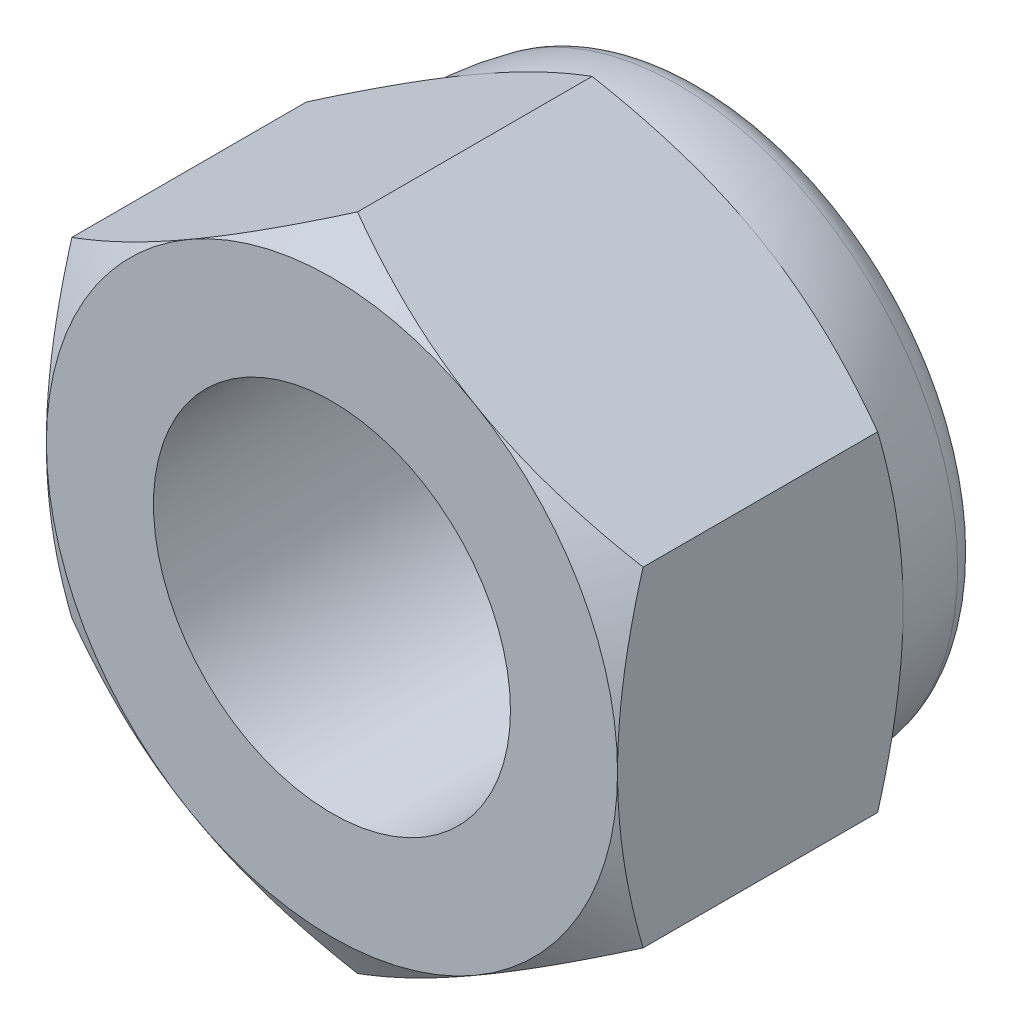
ISO-10303-21;
HEADER;
FILE_DESCRIPTION(('STEP AP214'),'2;1');
FILE_NAME('part.step','',(''),(''),'','','');
FILE_SCHEMA(('AUTOMOTIVE_DESIGN { 1 0 10303 214 1 1 1 1 }'));
ENDSEC;
DATA;
#1=APPLICATION_CONTEXT('core data for automotive mechanical design processes');
#2=APPLICATION_PROTOCOL_DEFINITION('international standard','automotive_design',2000,#1);
#3=PRODUCT_CONTEXT('',#1,'mechanical');
#4=PRODUCT('Part','Part','',(#3));
#5=PRODUCT_RELATED_PRODUCT_CATEGORY('part','',(#4));
#6=PRODUCT_DEFINITION_FORMATION('','',#4);
#7=PRODUCT_DEFINITION_CONTEXT('part definition',#1,'design');
#8=PRODUCT_DEFINITION('design','',#6,#7);
#9=PRODUCT_DEFINITION_SHAPE('','',#8);
#10=(LENGTH_UNIT() NAMED_UNIT(*) SI_UNIT(.MILLI.,.METRE.));
#11=(NAMED_UNIT(*) PLANE_ANGLE_UNIT() SI_UNIT($,.RADIAN.));
#12=(NAMED_UNIT(*) SI_UNIT($,.STERADIAN.) SOLID_ANGLE_UNIT());
#13=UNCERTAINTY_MEASURE_WITH_UNIT(LENGTH_MEASURE(1.E-05),#10,'distance_accuracy_value','');
#14=(GEOMETRIC_REPRESENTATION_CONTEXT(3) GLOBAL_UNCERTAINTY_ASSIGNED_CONTEXT((#13)) GLOBAL_UNIT_ASSIGNED_CONTEXT((#10,
#11,#12)) REPRESENTATION_CONTEXT('',''));
#15=CARTESIAN_POINT('',(0.,0.,0.));
#16=DIRECTION('',(0.,0.,1.));
#17=DIRECTION('',(1.,0.,0.));
#18=AXIS2_PLACEMENT_3D('',#15,#16,#17);
#19=CARTESIAN_POINT('',(0.,0.,-10.5));
#20=DIRECTION('',(0.,0.,1.));
#21=DIRECTION('',(1.,0.,0.));
#22=AXIS2_PLACEMENT_3D('',#19,#20,#21);
#23=CYLINDRICAL_SURFACE('',#22,5.);
#24=CARTESIAN_POINT('',(0.,0.,0.));
#25=DIRECTION('',(0.,0.,1.));
#26=DIRECTION('',(1.,0.,0.));
#27=AXIS2_PLACEMENT_3D('',#24,#25,#26);
#28=CIRCLE('',#27,5.);
#29=CARTESIAN_POINT('',(5.,0.,0.));
#30=VERTEX_POINT('',#29);
#31=EDGE_CURVE('E165',#30,#30,#28,.T.);
#32=CARTESIAN_POINT('',(0.,0.,-9.1));
#33=DIRECTION('',(0.,0.,-1.));
#34=DIRECTION('',(-1.,0.,0.));
#35=AXIS2_PLACEMENT_3D('',#32,#33,#34);
#36=CIRCLE('',#35,5.);
#37=CARTESIAN_POINT('',(5.,0.,-9.1));
#38=VERTEX_POINT('',#37);
#39=EDGE_CURVE('E11',#38,#38,#36,.F.);
#40=CARTESIAN_POINT('',(5.,0.,0.));
#41=CARTESIAN_POINT('',(5.,0.,-0.0947916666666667));
#42=CARTESIAN_POINT('',(5.,0.,-0.189583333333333));
#43=CARTESIAN_POINT('',(5.,0.,-0.379166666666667));
#44=CARTESIAN_POINT('',(5.,0.,-0.473958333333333));
#45=CARTESIAN_POINT('',(5.,0.,-0.663541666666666));
#46=CARTESIAN_POINT('',(5.,0.,-0.758333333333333));
#47=CARTESIAN_POINT('',(5.,0.,-0.947916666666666));
#48=CARTESIAN_POINT('',(5.,0.,-1.04270833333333));
#49=CARTESIAN_POINT('',(5.,0.,-1.23229166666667));
#50=CARTESIAN_POINT('',(5.,0.,-1.32708333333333));
#51=CARTESIAN_POINT('',(5.,0.,-1.51666666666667));
#52=CARTESIAN_POINT('',(5.,0.,-1.61145833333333));
#53=CARTESIAN_POINT('',(5.,0.,-1.80104166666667));
#54=CARTESIAN_POINT('',(5.,0.,-1.89583333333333));
#55=CARTESIAN_POINT('',(5.,0.,-2.08541666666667));
#56=CARTESIAN_POINT('',(5.,0.,-2.18020833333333));
#57=CARTESIAN_POINT('',(5.,0.,-2.36979166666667));
#58=CARTESIAN_POINT('',(5.,0.,-2.46458333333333));
#59=CARTESIAN_POINT('',(5.,0.,-2.65416666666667));
#60=CARTESIAN_POINT('',(5.,0.,-2.74895833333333));
#61=CARTESIAN_POINT('',(5.,0.,-2.93854166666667));
#62=CARTESIAN_POINT('',(5.,0.,-3.03333333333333));
#63=CARTESIAN_POINT('',(5.,0.,-3.22291666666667));
#64=CARTESIAN_POINT('',(5.,0.,-3.31770833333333));
#65=CARTESIAN_POINT('',(5.,0.,-3.50729166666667));
#66=CARTESIAN_POINT('',(5.,0.,-3.60208333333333));
#67=CARTESIAN_POINT('',(5.,0.,-3.79166666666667));
#68=CARTESIAN_POINT('',(5.,0.,-3.88645833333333));
#69=CARTESIAN_POINT('',(5.,0.,-4.07604166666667));
#70=CARTESIAN_POINT('',(5.,0.,-4.17083333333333));
#71=CARTESIAN_POINT('',(5.,0.,-4.36041666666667));
#72=CARTESIAN_POINT('',(5.,0.,-4.45520833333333));
#73=CARTESIAN_POINT('',(5.,0.,-4.64479166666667));
#74=CARTESIAN_POINT('',(5.,0.,-4.73958333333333));
#75=CARTESIAN_POINT('',(5.,0.,-4.92916666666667));
#76=CARTESIAN_POINT('',(5.,0.,-5.02395833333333));
#77=CARTESIAN_POINT('',(5.,0.,-5.21354166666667));
#78=CARTESIAN_POINT('',(5.,0.,-5.30833333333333));
#79=CARTESIAN_POINT('',(5.,0.,-5.49791666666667));
#80=CARTESIAN_POINT('',(5.,0.,-5.59270833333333));
#81=CARTESIAN_POINT('',(5.,0.,-5.78229166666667));
#82=CARTESIAN_POINT('',(5.,0.,-5.87708333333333));
#83=CARTESIAN_POINT('',(5.,0.,-6.06666666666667));
#84=CARTESIAN_POINT('',(5.,0.,-6.16145833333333));
#85=CARTESIAN_POINT('',(5.,0.,-6.35104166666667));
#86=CARTESIAN_POINT('',(5.,0.,-6.44583333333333));
#87=CARTESIAN_POINT('',(5.,0.,-6.63541666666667));
#88=CARTESIAN_POINT('',(5.,0.,-6.73020833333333));
#89=CARTESIAN_POINT('',(5.,0.,-6.91979166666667));
#90=CARTESIAN_POINT('',(5.,0.,-7.01458333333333));
#91=CARTESIAN_POINT('',(5.,0.,-7.20416666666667));
#92=CARTESIAN_POINT('',(5.,0.,-7.29895833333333));
#93=CARTESIAN_POINT('',(5.,0.,-7.48854166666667));
#94=CARTESIAN_POINT('',(5.,0.,-7.58333333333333));
#95=CARTESIAN_POINT('',(5.,0.,-7.77291666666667));
#96=CARTESIAN_POINT('',(5.,0.,-7.86770833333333));
#97=CARTESIAN_POINT('',(5.,0.,-8.05729166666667));
#98=CARTESIAN_POINT('',(5.,0.,-8.15208333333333));
#99=CARTESIAN_POINT('',(5.,0.,-8.34166666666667));
#100=CARTESIAN_POINT('',(5.,0.,-8.43645833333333));
#101=CARTESIAN_POINT('',(5.,0.,-8.62604166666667));
#102=CARTESIAN_POINT('',(5.,0.,-8.72083333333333));
#103=CARTESIAN_POINT('',(5.,0.,-8.91041666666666));
#104=CARTESIAN_POINT('',(5.,0.,-9.00520833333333));
#105=CARTESIAN_POINT('',(5.,0.,-9.1));
#106=B_SPLINE_CURVE_WITH_KNOTS('',3,(#40,#41,#42,#43,#44,#45,#46,#47,#48,#49,#50,#51,#52,#53,
#54,#55,#56,#57,#58,#59,#60,#61,#62,#63,#64,#65,#66,#67,#68,#69,#70,#71,#72,#73,#74,#75,#76,#77,
#78,#79,#80,#81,#82,#83,#84,#85,#86,#87,#88,#89,#90,#91,#92,#93,#94,#95,#96,#97,#98,#99,#100,
#101,#102,#103,#104,#105),.UNSPECIFIED.,.F.,.F.,(4,2,2,2,2,2,2,2,2,2,2,2,2,2,2,2,2,2,2,2,2,2,2,
2,2,2,2,2,2,2,2,2,4),(0.,0.284375,0.56875,0.853125,1.1375,1.421875,1.70625,1.990625,2.275,
2.559375,2.84375,3.128125,3.4125,3.696875,3.98125,4.265625,4.55,4.834375,5.11875,5.403125,
5.6875,5.971875,6.25625,6.540625,6.825,7.109375,7.39375,7.678125,7.9625,8.246875,8.53125,
8.815625,9.1),.UNSPECIFIED.);
#107=EDGE_CURVE('BSEAM38',#30,#38,#106,.T.);
#108=ORIENTED_EDGE('',*,*,#31,.T.);
#109=ORIENTED_EDGE('',*,*,#39,.F.);
#110=ORIENTED_EDGE('',*,*,#107,.T.);
#111=ORIENTED_EDGE('',*,*,#107,.F.);
#112=EDGE_LOOP('',(#108,#110,#109,#111));
#113=FACE_BOUND('',#112,.T.);
#114=ADVANCED_FACE('F38',(#113),#23,.F.);
#115=CARTESIAN_POINT('',(-8.,13.856406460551,0.));
#116=DIRECTION('',(0.,0.,-1.));
#117=DIRECTION('',(-1.,0.,0.));
#118=AXIS2_PLACEMENT_3D('',#115,#116,#117);
#119=PLANE('',#118);
#120=ORIENTED_EDGE('',*,*,#31,.F.);
#121=EDGE_LOOP('',(#120));
#122=FACE_BOUND('',#121,.T.);
#123=CARTESIAN_POINT('',(0.,0.,0.));
#124=DIRECTION('',(0.,0.,-1.));
#125=DIRECTION('',(-1.,0.,0.));
#126=AXIS2_PLACEMENT_3D('',#123,#124,#125);
#127=CIRCLE('',#126,8.);
#128=CARTESIAN_POINT('',(-8.,0.,0.));
#129=VERTEX_POINT('',#128);
#130=CARTESIAN_POINT('',(-4.,6.92820323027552,0.));
#131=VERTEX_POINT('',#130);
#132=EDGE_CURVE('E164',#129,#131,#127,.T.);
#133=ORIENTED_EDGE('',*,*,#132,.F.);
#134=CARTESIAN_POINT('',(0.,0.,0.));
#135=DIRECTION('',(0.,0.,-1.));
#136=DIRECTION('',(-1.,0.,0.));
#137=AXIS2_PLACEMENT_3D('',#134,#135,#136);
#138=CIRCLE('',#137,8.);
#139=CARTESIAN_POINT('',(-4.,-6.92820323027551,0.));
#140=VERTEX_POINT('',#139);
#141=EDGE_CURVE('E152',#129,#140,#138,.F.);
#142=ORIENTED_EDGE('',*,*,#141,.T.);
#143=CARTESIAN_POINT('',(4.,-6.92820323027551,0.));
#144=VERTEX_POINT('',#143);
#145=EDGE_CURVE('E270',#140,#144,#138,.F.);
#146=ORIENTED_EDGE('',*,*,#145,.T.);
#147=CARTESIAN_POINT('',(8.,0.,0.));
#148=VERTEX_POINT('',#147);
#149=EDGE_CURVE('E565',#144,#148,#138,.F.);
#150=ORIENTED_EDGE('',*,*,#149,.T.);
#151=CARTESIAN_POINT('',(4.,6.92820323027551,0.));
#152=VERTEX_POINT('',#151);
#153=EDGE_CURVE('E564',#148,#152,#138,.F.);
#154=ORIENTED_EDGE('',*,*,#153,.T.);
#155=EDGE_CURVE('E256',#152,#131,#138,.F.);
#156=ORIENTED_EDGE('',*,*,#155,.T.);
#157=EDGE_LOOP('',(#133,#142,#146,#150,#154,#156));
#158=FACE_BOUND('',#157,.T.);
#159=ADVANCED_FACE('F194',(#122,#158),#119,.F.);
#160=CARTESIAN_POINT('',(0.,0.,0.));
#161=DIRECTION('',(0.,0.,-1.));
#162=DIRECTION('',(-1.,0.,0.));
#163=AXIS2_PLACEMENT_3D('',#160,#161,#162);
#164=CONICAL_SURFACE('',#163,8.,1.0471975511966);
#165=CARTESIAN_POINT('',(-8.,-12.4289414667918,-3.9150243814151));
#166=CARTESIAN_POINT('',(-8.,-12.0792916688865,-3.74532345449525));
#167=CARTESIAN_POINT('',(-8.,-11.7288415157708,-3.57724345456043));
#168=CARTESIAN_POINT('',(-8.,-11.0259148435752,-3.24523667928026));
#169=CARTESIAN_POINT('',(-8.,-10.6734380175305,-3.08131055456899));
#170=CARTESIAN_POINT('',(-8.,-9.96422754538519,-2.75770323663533));
#171=CARTESIAN_POINT('',(-8.,-9.60748118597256,-2.598049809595));
#172=CARTESIAN_POINT('',(-8.,-8.89115828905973,-2.28524838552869));
#173=CARTESIAN_POINT('',(-8.,-8.53158188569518,-2.13210008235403));
#174=CARTESIAN_POINT('',(-8.,-7.79743820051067,-1.82924542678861));
#175=CARTESIAN_POINT('',(-8.,-7.42275986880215,-1.67980678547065));
#176=CARTESIAN_POINT('',(-8.,-6.6690292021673,-1.39218569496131));
#177=CARTESIAN_POINT('',(-8.,-6.28997638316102,-1.2540045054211));
#178=CARTESIAN_POINT('',(-8.,-5.52759087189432,-0.992509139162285));
#179=CARTESIAN_POINT('',(-8.,-5.14426853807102,-0.869165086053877));
#180=CARTESIAN_POINT('',(-8.,-4.37213964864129,-0.641285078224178));
#181=CARTESIAN_POINT('',(-8.,-3.98333485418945,-0.536743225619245));
#182=CARTESIAN_POINT('',(-8.,-3.2020639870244,-0.352019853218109));
#183=CARTESIAN_POINT('',(-8.,-2.80962942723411,-0.271708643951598));
#184=CARTESIAN_POINT('',(-8.,-2.21738673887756,-0.17289261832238));
#185=CARTESIAN_POINT('',(-8.,-2.01935997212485,-0.143561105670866));
#186=CARTESIAN_POINT('',(-8.,-1.62231457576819,-0.0926897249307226));
#187=CARTESIAN_POINT('',(-8.,-1.42329604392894,-0.0711491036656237));
#188=CARTESIAN_POINT('',(-8.,-1.02714522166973,-0.0365601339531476));
#189=CARTESIAN_POINT('',(-8.,-0.830022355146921,-0.0234042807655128));
#190=CARTESIAN_POINT('',(-8.,-0.43539689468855,-0.00544139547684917));
#191=CARTESIAN_POINT('',(-8.,-0.237894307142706,-0.000634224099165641));
#192=CARTESIAN_POINT('',(-8.,0.157138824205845,0.00051656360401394));
#193=CARTESIAN_POINT('',(-8.,0.354669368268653,-0.00313990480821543));
#194=CARTESIAN_POINT('',(-8.,0.749400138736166,-0.0188268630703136));
#195=CARTESIAN_POINT('',(-8.,0.946600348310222,-0.0308577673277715));
#196=CARTESIAN_POINT('',(-8.,1.4197678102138,-0.0695170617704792));
#197=CARTESIAN_POINT('',(-8.,1.69542073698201,-0.100076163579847));
#198=CARTESIAN_POINT('',(-8.,2.24468314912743,-0.175896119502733));
#199=CARTESIAN_POINT('',(-8.,2.51829235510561,-0.221158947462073));
#200=CARTESIAN_POINT('',(-8.,3.33573277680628,-0.376603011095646));
#201=CARTESIAN_POINT('',(-8.,3.87588099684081,-0.506412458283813));
#202=CARTESIAN_POINT('',(-8.,4.68375598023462,-0.731593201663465));
#203=CARTESIAN_POINT('',(-8.,4.95566805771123,-0.812812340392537));
#204=CARTESIAN_POINT('',(-8.,5.49685040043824,-0.983699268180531));
#205=CARTESIAN_POINT('',(-8.,5.76612064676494,-1.07336711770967));
#206=CARTESIAN_POINT('',(-8.,6.30210618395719,-1.25971133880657));
#207=CARTESIAN_POINT('',(-8.,6.56882226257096,-1.35638546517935));
#208=CARTESIAN_POINT('',(-8.,7.10004114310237,-1.55560318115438));
#209=CARTESIAN_POINT('',(-8.,7.36454398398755,-1.65814666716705));
#210=CARTESIAN_POINT('',(-8.,8.03954864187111,-1.92707319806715));
#211=CARTESIAN_POINT('',(-8.,8.44864651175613,-2.09697564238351));
#212=CARTESIAN_POINT('',(-8.,9.26296702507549,-2.44585611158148));
#213=CARTESIAN_POINT('',(-8.,9.66818933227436,-2.62483491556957));
#214=CARTESIAN_POINT('',(-8.,10.4755817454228,-2.98985031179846));
#215=CARTESIAN_POINT('',(-8.,10.87775088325,-3.1758890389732));
#216=CARTESIAN_POINT('',(-8.,11.6794880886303,-3.55344155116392));
#217=CARTESIAN_POINT('',(-8.,12.0790562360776,-3.74495516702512));
#218=CARTESIAN_POINT('',(-8.,12.8766152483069,-4.13259501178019));
#219=CARTESIAN_POINT('',(-8.,13.274603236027,-4.32872714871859));
#220=CARTESIAN_POINT('',(-8.,14.068831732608,-4.72449899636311));
#221=CARTESIAN_POINT('',(-8.,14.465072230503,-4.92413872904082));
#222=CARTESIAN_POINT('',(-8.,15.2560315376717,-5.32623624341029));
#223=CARTESIAN_POINT('',(-8.,15.650750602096,-5.52869352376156));
#224=CARTESIAN_POINT('',(-8.,16.4389741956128,-5.93595999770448));
#225=CARTESIAN_POINT('',(-8.,16.8324787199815,-6.14076920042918));
#226=CARTESIAN_POINT('',(-8.,17.9357396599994,-6.71846514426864));
#227=CARTESIAN_POINT('',(-8.,18.6443410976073,-7.09355729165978));
#228=CARTESIAN_POINT('',(-8.,20.0590897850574,-7.84841354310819));
#229=CARTESIAN_POINT('',(-8.,20.7652369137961,-8.22817787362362));
#230=CARTESIAN_POINT('',(-8.,22.1735698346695,-8.99010012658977));
#231=CARTESIAN_POINT('',(-8.,22.875761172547,-9.372247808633));
#232=CARTESIAN_POINT('',(-8.,24.2786001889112,-10.1392568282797));
#233=CARTESIAN_POINT('',(-8.,24.9792479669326,-10.5241179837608));
#234=CARTESIAN_POINT('',(-8.,25.6793433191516,-10.9099740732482));
#235=B_SPLINE_CURVE_WITH_KNOTS('',3,(#165,#166,#167,#168,#169,#170,#171,#172,#173,#174,#175,
#176,#177,#178,#179,#180,#181,#182,#183,#184,#185,#186,#187,#188,#189,#190,#191,#192,#193,#194,
#195,#196,#197,#198,#199,#200,#201,#202,#203,#204,#205,#206,#207,#208,#209,#210,#211,#212,#213,
#214,#215,#216,#217,#218,#219,#220,#221,#222,#223,#224,#225,#226,#227,#228,#229,#230,#231,#232,
#233,#234),.UNSPECIFIED.,.F.,.F.,(4,2,2,2,2,2,2,2,2,2,2,2,2,2,2,2,2,2,2,2,2,2,2,2,2,2,2,2,2,2,2,
2,2,2,4),(0.,1.16598174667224,2.33214500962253,3.50461785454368,4.67703545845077,
5.88703631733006,7.09717238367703,8.30482938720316,9.51210690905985,10.7128031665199,
11.3132358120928,11.9136103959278,12.5061236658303,13.0986270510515,13.6911363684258,
14.2836750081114,15.1152308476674,15.9468983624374,17.6111205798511,18.4623977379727,
19.3136809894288,20.1646926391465,21.0156892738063,22.3444603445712,23.6733456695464,
25.0026361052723,26.3318855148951,27.6629391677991,28.9940011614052,30.3248292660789,
31.6556625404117,34.0608989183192,36.4662523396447,38.8645752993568,41.2627387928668),.UNSPECIFIED.);
#236=CARTESIAN_POINT('',(-8.,4.61880215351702,-0.714531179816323));
#237=VERTEX_POINT('',#236);
#238=EDGE_CURVE('E181',#237,#129,#235,.F.);
#239=ORIENTED_EDGE('',*,*,#238,.T.);
#240=ORIENTED_EDGE('',*,*,#132,.T.);
#241=CARTESIAN_POINT('',(0.0002,9.23771977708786,-0.714597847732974));
#242=CARTESIAN_POINT('',(-0.175648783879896,9.13619343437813,-0.6559907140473));
#243=CARTESIAN_POINT('',(-0.352153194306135,9.03428856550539,-0.600043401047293));
#244=CARTESIAN_POINT('',(-0.70659546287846,8.82965122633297,-0.494201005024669));
#245=CARTESIAN_POINT('',(-0.884533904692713,8.72691841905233,-0.444308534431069));
#246=CARTESIAN_POINT('',(-1.42119823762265,8.41707512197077,-0.304692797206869));
#247=CARTESIAN_POINT('',(-1.78204258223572,8.20874154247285,-0.225281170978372));
#248=CARTESIAN_POINT('',(-2.32203917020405,7.89697436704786,-0.132161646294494));
#249=CARTESIAN_POINT('',(-2.49957818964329,7.79447216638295,-0.10563458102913));
#250=CARTESIAN_POINT('',(-2.8554591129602,7.58900421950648,-0.0611531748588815));
#251=CARTESIAN_POINT('',(-3.03380094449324,7.48603851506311,-0.0431980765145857));
#252=CARTESIAN_POINT('',(-3.3907916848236,7.27992981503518,-0.0163156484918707));
#253=CARTESIAN_POINT('',(-3.5694400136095,7.17678715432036,-0.00737807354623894));
#254=CARTESIAN_POINT('',(-3.92690170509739,6.97040655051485,0.00127769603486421));
#255=CARTESIAN_POINT('',(-4.10571506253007,6.86716861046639,0.000996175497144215));
#256=CARTESIAN_POINT('',(-4.44001336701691,6.67416139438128,-0.00814502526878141));
#257=CARTESIAN_POINT('',(-4.59552190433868,6.58437849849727,-0.0158896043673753));
#258=CARTESIAN_POINT('',(-4.90617476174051,6.40502298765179,-0.0382011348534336));
#259=CARTESIAN_POINT('',(-5.06131905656,6.31545038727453,-0.0527685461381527));
#260=CARTESIAN_POINT('',(-5.52615131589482,6.04707935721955,-0.10636069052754));
#261=CARTESIAN_POINT('',(-5.83501648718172,5.86875596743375,-0.155268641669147));
#262=CARTESIAN_POINT('',(-6.4560232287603,5.51021755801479,-0.277539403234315));
#263=CARTESIAN_POINT('',(-6.76808554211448,5.33004829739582,-0.351420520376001));
#264=CARTESIAN_POINT('',(-7.38755648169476,4.97239658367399,-0.519100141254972));
#265=CARTESIAN_POINT('',(-7.69497304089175,4.79490955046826,-0.612859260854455));
#266=CARTESIAN_POINT('',(-8.0002,4.61868668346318,-0.714597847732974));
#267=B_SPLINE_CURVE_WITH_KNOTS('',3,(#241,#242,#243,#244,#245,#246,#247,#248,#249,#250,#251,
#252,#253,#254,#255,#256,#257,#258,#259,#260,#261,#262,#263,#264,#265,#266),.UNSPECIFIED.,.F.,
.F.,(4,2,2,2,2,2,2,2,2,2,2,2,4),(0.,0.633973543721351,1.26821965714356,2.53934712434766,
3.15934343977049,3.77928496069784,4.39852133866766,5.01773858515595,5.55680239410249,
6.09590254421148,7.17487077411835,8.27776850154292,9.37850115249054),.UNSPECIFIED.);
#268=EDGE_CURVE('E168',#131,#237,#267,.T.);
#269=ORIENTED_EDGE('',*,*,#268,.T.);
#270=EDGE_LOOP('',(#239,#240,#269));
#271=FACE_BOUND('',#270,.T.);
#272=ADVANCED_FACE('F188',(#271),#164,.T.);
#273=CARTESIAN_POINT('',(8.0002,4.61868668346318,-0.714597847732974));
#274=CARTESIAN_POINT('',(7.8243512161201,4.72021302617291,-0.6559907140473));
#275=CARTESIAN_POINT('',(7.64784680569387,4.82211789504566,-0.600043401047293));
#276=CARTESIAN_POINT('',(7.29340453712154,5.02675523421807,-0.494201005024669));
#277=CARTESIAN_POINT('',(7.11546609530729,5.12948804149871,-0.44430853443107));
#278=CARTESIAN_POINT('',(6.57880176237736,5.43933133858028,-0.304692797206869));
#279=CARTESIAN_POINT('',(6.21795741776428,5.64766491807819,-0.225281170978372));
#280=CARTESIAN_POINT('',(5.67796082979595,5.95943209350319,-0.132161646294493));
#281=CARTESIAN_POINT('',(5.50042181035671,6.06193429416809,-0.105634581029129));
#282=CARTESIAN_POINT('',(5.1445408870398,6.26740224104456,-0.0611531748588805));
#283=CARTESIAN_POINT('',(4.96619905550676,6.37036794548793,-0.0431980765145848));
#284=CARTESIAN_POINT('',(4.6092083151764,6.57647664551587,-0.0163156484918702));
#285=CARTESIAN_POINT('',(4.4305599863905,6.67961930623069,-0.00737807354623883));
#286=CARTESIAN_POINT('',(4.07309829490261,6.88599991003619,0.00127769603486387));
#287=CARTESIAN_POINT('',(3.89428493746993,6.98923785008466,0.000996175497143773));
#288=CARTESIAN_POINT('',(3.55998663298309,7.18224506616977,-0.00814502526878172));
#289=CARTESIAN_POINT('',(3.40447809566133,7.27202796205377,-0.0158896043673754));
#290=CARTESIAN_POINT('',(3.09382523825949,7.45138347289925,-0.0382011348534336));
#291=CARTESIAN_POINT('',(2.93868094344,7.54095607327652,-0.0527685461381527));
#292=CARTESIAN_POINT('',(2.47384868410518,7.8093271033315,-0.106360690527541));
#293=CARTESIAN_POINT('',(2.16498351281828,7.98765049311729,-0.155268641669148));
#294=CARTESIAN_POINT('',(1.5439767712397,8.34618890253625,-0.277539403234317));
#295=CARTESIAN_POINT('',(1.23191445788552,8.52635816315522,-0.351420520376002));
#296=CARTESIAN_POINT('',(0.61244351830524,8.88400987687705,-0.519100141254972));
#297=CARTESIAN_POINT('',(0.305026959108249,9.06149691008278,-0.612859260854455));
#298=CARTESIAN_POINT('',(-0.000199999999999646,9.23771977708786,-0.714597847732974));
#299=B_SPLINE_CURVE_WITH_KNOTS('',3,(#273,#274,#275,#276,#277,#278,#279,#280,#281,#282,#283,
#284,#285,#286,#287,#288,#289,#290,#291,#292,#293,#294,#295,#296,#297,#298),.UNSPECIFIED.,.F.,
.F.,(4,2,2,2,2,2,2,2,2,2,2,2,4),(0.,0.633973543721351,1.26821965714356,2.53934712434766,
3.15934343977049,3.77928496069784,4.39852133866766,5.01773858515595,5.55680239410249,
6.09590254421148,7.17487077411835,8.27776850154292,9.37850115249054),.UNSPECIFIED.);
#300=CARTESIAN_POINT('',(0.,9.23760430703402,-0.714531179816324));
#301=VERTEX_POINT('',#300);
#302=EDGE_CURVE('E206',#152,#301,#299,.T.);
#303=ORIENTED_EDGE('',*,*,#302,.T.);
#304=EDGE_CURVE('E180',#301,#131,#267,.T.);
#305=ORIENTED_EDGE('',*,*,#304,.T.);
#306=ORIENTED_EDGE('',*,*,#155,.F.);
#307=EDGE_LOOP('',(#303,#305,#306));
#308=FACE_BOUND('',#307,.T.);
#309=ADVANCED_FACE('F193',(#308),#164,.T.);
#310=CARTESIAN_POINT('',(8.,-12.4289414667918,-3.9150243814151));
#311=CARTESIAN_POINT('',(8.,-12.0792916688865,-3.74532345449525));
#312=CARTESIAN_POINT('',(8.,-11.7288415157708,-3.57724345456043));
#313=CARTESIAN_POINT('',(8.,-11.0259148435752,-3.24523667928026));
#314=CARTESIAN_POINT('',(8.,-10.6734380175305,-3.08131055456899));
#315=CARTESIAN_POINT('',(8.,-9.96422754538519,-2.75770323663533));
#316=CARTESIAN_POINT('',(8.,-9.60748118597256,-2.598049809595));
#317=CARTESIAN_POINT('',(8.,-8.89115828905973,-2.28524838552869));
#318=CARTESIAN_POINT('',(8.,-8.53158188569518,-2.13210008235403));
#319=CARTESIAN_POINT('',(8.,-7.79743820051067,-1.82924542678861));
#320=CARTESIAN_POINT('',(8.,-7.42275986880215,-1.67980678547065));
#321=CARTESIAN_POINT('',(8.,-6.6690292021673,-1.39218569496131));
#322=CARTESIAN_POINT('',(8.,-6.28997638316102,-1.2540045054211));
#323=CARTESIAN_POINT('',(8.,-5.52759087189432,-0.992509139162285));
#324=CARTESIAN_POINT('',(8.,-5.14426853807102,-0.869165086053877));
#325=CARTESIAN_POINT('',(8.,-4.37213964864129,-0.641285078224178));
#326=CARTESIAN_POINT('',(8.,-3.98333485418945,-0.536743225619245));
#327=CARTESIAN_POINT('',(8.,-3.2020639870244,-0.352019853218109));
#328=CARTESIAN_POINT('',(8.,-2.80962942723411,-0.271708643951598));
#329=CARTESIAN_POINT('',(8.,-2.21738673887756,-0.17289261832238));
#330=CARTESIAN_POINT('',(8.,-2.01935997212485,-0.143561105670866));
#331=CARTESIAN_POINT('',(8.,-1.62231457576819,-0.0926897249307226));
#332=CARTESIAN_POINT('',(8.,-1.42329604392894,-0.0711491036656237));
#333=CARTESIAN_POINT('',(8.,-1.02714522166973,-0.0365601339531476));
#334=CARTESIAN_POINT('',(8.,-0.830022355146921,-0.0234042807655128));
#335=CARTESIAN_POINT('',(8.,-0.43539689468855,-0.00544139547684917));
#336=CARTESIAN_POINT('',(8.,-0.237894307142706,-0.000634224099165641));
#337=CARTESIAN_POINT('',(8.,0.157138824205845,0.00051656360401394));
#338=CARTESIAN_POINT('',(8.,0.354669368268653,-0.00313990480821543));
#339=CARTESIAN_POINT('',(8.,0.749400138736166,-0.0188268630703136));
#340=CARTESIAN_POINT('',(8.,0.946600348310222,-0.0308577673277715));
#341=CARTESIAN_POINT('',(8.,1.4197678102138,-0.0695170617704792));
#342=CARTESIAN_POINT('',(8.,1.69542073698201,-0.100076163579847));
#343=CARTESIAN_POINT('',(8.,2.24468314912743,-0.175896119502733));
#344=CARTESIAN_POINT('',(8.,2.51829235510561,-0.221158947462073));
#345=CARTESIAN_POINT('',(8.,3.33573277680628,-0.376603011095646));
#346=CARTESIAN_POINT('',(8.,3.87588099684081,-0.506412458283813));
#347=CARTESIAN_POINT('',(8.,4.68375598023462,-0.731593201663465));
#348=CARTESIAN_POINT('',(8.,4.95566805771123,-0.812812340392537));
#349=CARTESIAN_POINT('',(8.,5.49685040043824,-0.983699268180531));
#350=CARTESIAN_POINT('',(8.,5.76612064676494,-1.07336711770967));
#351=CARTESIAN_POINT('',(8.,6.30210618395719,-1.25971133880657));
#352=CARTESIAN_POINT('',(8.,6.56882226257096,-1.35638546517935));
#353=CARTESIAN_POINT('',(8.,7.10004114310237,-1.55560318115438));
#354=CARTESIAN_POINT('',(8.,7.36454398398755,-1.65814666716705));
#355=CARTESIAN_POINT('',(8.,8.03954864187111,-1.92707319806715));
#356=CARTESIAN_POINT('',(8.,8.44864651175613,-2.09697564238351));
#357=CARTESIAN_POINT('',(8.,9.26296702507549,-2.44585611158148));
#358=CARTESIAN_POINT('',(8.,9.66818933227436,-2.62483491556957));
#359=CARTESIAN_POINT('',(8.,10.4755817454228,-2.98985031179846));
#360=CARTESIAN_POINT('',(8.,10.87775088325,-3.1758890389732));
#361=CARTESIAN_POINT('',(8.,11.6794880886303,-3.55344155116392));
#362=CARTESIAN_POINT('',(8.,12.0790562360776,-3.74495516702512));
#363=CARTESIAN_POINT('',(8.,12.8766152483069,-4.13259501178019));
#364=CARTESIAN_POINT('',(8.,13.274603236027,-4.32872714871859));
#365=CARTESIAN_POINT('',(8.,14.068831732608,-4.72449899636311));
#366=CARTESIAN_POINT('',(8.,14.465072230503,-4.92413872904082));
#367=CARTESIAN_POINT('',(8.,15.2560315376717,-5.32623624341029));
#368=CARTESIAN_POINT('',(8.,15.650750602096,-5.52869352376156));
#369=CARTESIAN_POINT('',(8.,16.4389741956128,-5.93595999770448));
#370=CARTESIAN_POINT('',(8.,16.8324787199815,-6.14076920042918));
#371=CARTESIAN_POINT('',(8.,17.9357396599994,-6.71846514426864));
#372=CARTESIAN_POINT('',(8.,18.6443410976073,-7.09355729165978));
#373=CARTESIAN_POINT('',(8.,20.0590897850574,-7.84841354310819));
#374=CARTESIAN_POINT('',(8.,20.7652369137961,-8.22817787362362));
#375=CARTESIAN_POINT('',(8.,22.1735698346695,-8.99010012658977));
#376=CARTESIAN_POINT('',(8.,22.875761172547,-9.372247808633));
#377=CARTESIAN_POINT('',(8.,24.2786001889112,-10.1392568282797));
#378=CARTESIAN_POINT('',(8.,24.9792479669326,-10.5241179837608));
#379=CARTESIAN_POINT('',(8.,25.6793433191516,-10.9099740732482));
#380=B_SPLINE_CURVE_WITH_KNOTS('',3,(#310,#311,#312,#313,#314,#315,#316,#317,#318,#319,#320,
#321,#322,#323,#324,#325,#326,#327,#328,#329,#330,#331,#332,#333,#334,#335,#336,#337,#338,#339,
#340,#341,#342,#343,#344,#345,#346,#347,#348,#349,#350,#351,#352,#353,#354,#355,#356,#357,#358,
#359,#360,#361,#362,#363,#364,#365,#366,#367,#368,#369,#370,#371,#372,#373,#374,#375,#376,#377,
#378,#379),.UNSPECIFIED.,.F.,.F.,(4,2,2,2,2,2,2,2,2,2,2,2,2,2,2,2,2,2,2,2,2,2,2,2,2,2,2,2,2,2,2,
2,2,2,4),(0.,1.16598174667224,2.33214500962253,3.50461785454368,4.67703545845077,
5.88703631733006,7.09717238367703,8.30482938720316,9.51210690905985,10.7128031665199,
11.3132358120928,11.9136103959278,12.5061236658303,13.0986270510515,13.6911363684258,
14.2836750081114,15.1152308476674,15.9468983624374,17.6111205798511,18.4623977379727,
19.3136809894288,20.1646926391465,21.0156892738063,22.3444603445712,23.6733456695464,
25.0026361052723,26.3318855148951,27.6629391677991,28.9940011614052,30.3248292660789,
31.6556625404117,34.0608989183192,36.4662523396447,38.8645752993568,41.2627387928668),.UNSPECIFIED.);
#381=CARTESIAN_POINT('',(8.,4.61880215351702,-0.714531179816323));
#382=VERTEX_POINT('',#381);
#383=EDGE_CURVE('E217',#148,#382,#380,.T.);
#384=ORIENTED_EDGE('',*,*,#383,.T.);
#385=EDGE_CURVE('E534',#382,#152,#299,.T.);
#386=ORIENTED_EDGE('',*,*,#385,.T.);
#387=ORIENTED_EDGE('',*,*,#153,.F.);
#388=EDGE_LOOP('',(#384,#386,#387));
#389=FACE_BOUND('',#388,.T.);
#390=ADVANCED_FACE('F397',(#389),#164,.T.);
#391=CARTESIAN_POINT('',(-0.0002,-9.23771977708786,-0.714597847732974));
#392=CARTESIAN_POINT('',(0.175648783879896,-9.13619343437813,-0.6559907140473));
#393=CARTESIAN_POINT('',(0.352153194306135,-9.03428856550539,-0.600043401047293));
#394=CARTESIAN_POINT('',(0.70659546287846,-8.82965122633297,-0.494201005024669));
#395=CARTESIAN_POINT('',(0.884533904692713,-8.72691841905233,-0.444308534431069));
#396=CARTESIAN_POINT('',(1.42119823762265,-8.41707512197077,-0.304692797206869));
#397=CARTESIAN_POINT('',(1.78204258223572,-8.20874154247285,-0.225281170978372));
#398=CARTESIAN_POINT('',(2.32203917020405,-7.89697436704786,-0.132161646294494));
#399=CARTESIAN_POINT('',(2.49957818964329,-7.79447216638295,-0.10563458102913));
#400=CARTESIAN_POINT('',(2.8554591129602,-7.58900421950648,-0.0611531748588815));
#401=CARTESIAN_POINT('',(3.03380094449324,-7.48603851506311,-0.0431980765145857));
#402=CARTESIAN_POINT('',(3.3907916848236,-7.27992981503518,-0.0163156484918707));
#403=CARTESIAN_POINT('',(3.5694400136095,-7.17678715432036,-0.00737807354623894));
#404=CARTESIAN_POINT('',(3.92690170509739,-6.97040655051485,0.00127769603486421));
#405=CARTESIAN_POINT('',(4.10571506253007,-6.86716861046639,0.000996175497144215));
#406=CARTESIAN_POINT('',(4.44001336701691,-6.67416139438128,-0.00814502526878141));
#407=CARTESIAN_POINT('',(4.59552190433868,-6.58437849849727,-0.0158896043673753));
#408=CARTESIAN_POINT('',(4.90617476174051,-6.40502298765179,-0.0382011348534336));
#409=CARTESIAN_POINT('',(5.06131905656,-6.31545038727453,-0.0527685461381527));
#410=CARTESIAN_POINT('',(5.52615131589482,-6.04707935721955,-0.10636069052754));
#411=CARTESIAN_POINT('',(5.83501648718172,-5.86875596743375,-0.155268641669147));
#412=CARTESIAN_POINT('',(6.4560232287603,-5.51021755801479,-0.277539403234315));
#413=CARTESIAN_POINT('',(6.76808554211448,-5.33004829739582,-0.351420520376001));
#414=CARTESIAN_POINT('',(7.38755648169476,-4.97239658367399,-0.519100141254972));
#415=CARTESIAN_POINT('',(7.69497304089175,-4.79490955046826,-0.612859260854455));
#416=CARTESIAN_POINT('',(8.0002,-4.61868668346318,-0.714597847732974));
#417=B_SPLINE_CURVE_WITH_KNOTS('',3,(#391,#392,#393,#394,#395,#396,#397,#398,#399,#400,#401,
#402,#403,#404,#405,#406,#407,#408,#409,#410,#411,#412,#413,#414,#415,#416),.UNSPECIFIED.,.F.,
.F.,(4,2,2,2,2,2,2,2,2,2,2,2,4),(0.,0.633973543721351,1.26821965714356,2.53934712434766,
3.15934343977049,3.77928496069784,4.39852133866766,5.01773858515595,5.55680239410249,
6.09590254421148,7.17487077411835,8.27776850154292,9.37850115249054),.UNSPECIFIED.);
#418=CARTESIAN_POINT('',(8.,-4.61880215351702,-0.714531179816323));
#419=VERTEX_POINT('',#418);
#420=EDGE_CURVE('E223',#144,#419,#417,.T.);
#421=ORIENTED_EDGE('',*,*,#420,.T.);
#422=EDGE_CURVE('E222',#419,#148,#380,.T.);
#423=ORIENTED_EDGE('',*,*,#422,.T.);
#424=ORIENTED_EDGE('',*,*,#149,.F.);
#425=EDGE_LOOP('',(#421,#423,#424));
#426=FACE_BOUND('',#425,.T.);
#427=ADVANCED_FACE('F405',(#426),#164,.T.);
#428=CARTESIAN_POINT('',(0.,-9.23760430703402,-0.714531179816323));
#429=VERTEX_POINT('',#428);
#430=EDGE_CURVE('E141',#429,#144,#417,.T.);
#431=ORIENTED_EDGE('',*,*,#430,.T.);
#432=ORIENTED_EDGE('',*,*,#145,.F.);
#433=CARTESIAN_POINT('',(-8.0002,-4.61868668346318,-0.714597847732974));
#434=CARTESIAN_POINT('',(-7.8243512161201,-4.72021302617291,-0.6559907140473));
#435=CARTESIAN_POINT('',(-7.64784680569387,-4.82211789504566,-0.600043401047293));
#436=CARTESIAN_POINT('',(-7.29340453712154,-5.02675523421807,-0.494201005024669));
#437=CARTESIAN_POINT('',(-7.11546609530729,-5.12948804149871,-0.44430853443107));
#438=CARTESIAN_POINT('',(-6.57880176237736,-5.43933133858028,-0.304692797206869));
#439=CARTESIAN_POINT('',(-6.21795741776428,-5.64766491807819,-0.225281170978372));
#440=CARTESIAN_POINT('',(-5.67796082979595,-5.95943209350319,-0.132161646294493));
#441=CARTESIAN_POINT('',(-5.50042181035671,-6.06193429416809,-0.105634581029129));
#442=CARTESIAN_POINT('',(-5.1445408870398,-6.26740224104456,-0.0611531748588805));
#443=CARTESIAN_POINT('',(-4.96619905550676,-6.37036794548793,-0.0431980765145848));
#444=CARTESIAN_POINT('',(-4.6092083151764,-6.57647664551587,-0.0163156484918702));
#445=CARTESIAN_POINT('',(-4.4305599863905,-6.67961930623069,-0.00737807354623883));
#446=CARTESIAN_POINT('',(-4.07309829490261,-6.88599991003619,0.00127769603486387));
#447=CARTESIAN_POINT('',(-3.89428493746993,-6.98923785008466,0.000996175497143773));
#448=CARTESIAN_POINT('',(-3.55998663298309,-7.18224506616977,-0.00814502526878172));
#449=CARTESIAN_POINT('',(-3.40447809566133,-7.27202796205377,-0.0158896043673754));
#450=CARTESIAN_POINT('',(-3.09382523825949,-7.45138347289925,-0.0382011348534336));
#451=CARTESIAN_POINT('',(-2.93868094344,-7.54095607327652,-0.0527685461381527));
#452=CARTESIAN_POINT('',(-2.47384868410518,-7.8093271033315,-0.106360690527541));
#453=CARTESIAN_POINT('',(-2.16498351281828,-7.98765049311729,-0.155268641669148));
#454=CARTESIAN_POINT('',(-1.5439767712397,-8.34618890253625,-0.277539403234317));
#455=CARTESIAN_POINT('',(-1.23191445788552,-8.52635816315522,-0.351420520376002));
#456=CARTESIAN_POINT('',(-0.61244351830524,-8.88400987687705,-0.519100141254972));
#457=CARTESIAN_POINT('',(-0.305026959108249,-9.06149691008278,-0.612859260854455));
#458=CARTESIAN_POINT('',(0.000199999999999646,-9.23771977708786,-0.714597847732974));
#459=B_SPLINE_CURVE_WITH_KNOTS('',3,(#433,#434,#435,#436,#437,#438,#439,#440,#441,#442,#443,
#444,#445,#446,#447,#448,#449,#450,#451,#452,#453,#454,#455,#456,#457,#458),.UNSPECIFIED.,.F.,
.F.,(4,2,2,2,2,2,2,2,2,2,2,2,4),(0.,0.633973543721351,1.26821965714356,2.53934712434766,
3.15934343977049,3.77928496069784,4.39852133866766,5.01773858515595,5.55680239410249,
6.09590254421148,7.17487077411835,8.27776850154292,9.37850115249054),.UNSPECIFIED.);
#460=EDGE_CURVE('E530',#140,#429,#459,.T.);
#461=ORIENTED_EDGE('',*,*,#460,.T.);
#462=EDGE_LOOP('',(#431,#432,#461));
#463=FACE_BOUND('',#462,.T.);
#464=ADVANCED_FACE('F196',(#463),#164,.T.);
#465=CARTESIAN_POINT('',(-8.,-4.61880215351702,-0.714531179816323));
#466=VERTEX_POINT('',#465);
#467=EDGE_CURVE('E211',#466,#140,#459,.T.);
#468=ORIENTED_EDGE('',*,*,#467,.T.);
#469=ORIENTED_EDGE('',*,*,#141,.F.);
#470=EDGE_CURVE('E532',#129,#466,#235,.F.);
#471=ORIENTED_EDGE('',*,*,#470,.T.);
#472=EDGE_LOOP('',(#468,#469,#471));
#473=FACE_BOUND('',#472,.T.);
#474=ADVANCED_FACE('F399',(#473),#164,.T.);
#475=CARTESIAN_POINT('',(8.,4.61880215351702,-8.));
#476=DIRECTION('',(0.499999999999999,0.866025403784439,0.));
#477=DIRECTION('',(-0.866025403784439,0.5,0.));
#478=AXIS2_PLACEMENT_3D('',#475,#476,#477);
#479=PLANE('',#478);
#480=CARTESIAN_POINT('',(-0.0002,9.23771977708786,-7.28540215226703));
#481=CARTESIAN_POINT('',(0.175648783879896,9.13619343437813,-7.3440092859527));
#482=CARTESIAN_POINT('',(0.352153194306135,9.03428856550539,-7.39995659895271));
#483=CARTESIAN_POINT('',(0.70659546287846,8.82965122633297,-7.50579899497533));
#484=CARTESIAN_POINT('',(0.884533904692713,8.72691841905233,-7.55569146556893));
#485=CARTESIAN_POINT('',(1.42119823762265,8.41707512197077,-7.69530720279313));
#486=CARTESIAN_POINT('',(1.78204258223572,8.20874154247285,-7.77471882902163));
#487=CARTESIAN_POINT('',(2.32203917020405,7.89697436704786,-7.86783835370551));
#488=CARTESIAN_POINT('',(2.49957818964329,7.79447216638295,-7.89436541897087));
#489=CARTESIAN_POINT('',(2.8554591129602,7.58900421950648,-7.93884682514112));
#490=CARTESIAN_POINT('',(3.03380094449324,7.48603851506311,-7.95680192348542));
#491=CARTESIAN_POINT('',(3.3907916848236,7.27992981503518,-7.98368435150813));
#492=CARTESIAN_POINT('',(3.5694400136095,7.17678715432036,-7.99262192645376));
#493=CARTESIAN_POINT('',(3.92690170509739,6.97040655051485,-8.00127769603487));
#494=CARTESIAN_POINT('',(4.10571506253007,6.86716861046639,-8.00099617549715));
#495=CARTESIAN_POINT('',(4.44001336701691,6.67416139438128,-7.99185497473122));
#496=CARTESIAN_POINT('',(4.59552190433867,6.58437849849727,-7.98411039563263));
#497=CARTESIAN_POINT('',(4.90617476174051,6.40502298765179,-7.96179886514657));
#498=CARTESIAN_POINT('',(5.06131905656,6.31545038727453,-7.94723145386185));
#499=CARTESIAN_POINT('',(5.52615131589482,6.04707935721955,-7.89363930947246));
#500=CARTESIAN_POINT('',(5.83501648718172,5.86875596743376,-7.84473135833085));
#501=CARTESIAN_POINT('',(6.4560232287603,5.51021755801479,-7.72246059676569));
#502=CARTESIAN_POINT('',(6.76808554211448,5.33004829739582,-7.648579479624));
#503=CARTESIAN_POINT('',(7.38755648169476,4.97239658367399,-7.48089985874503));
#504=CARTESIAN_POINT('',(7.69497304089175,4.79490955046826,-7.38714073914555));
#505=CARTESIAN_POINT('',(8.0002,4.61868668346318,-7.28540215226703));
#506=B_SPLINE_CURVE_WITH_KNOTS('',3,(#480,#481,#482,#483,#484,#485,#486,#487,#488,#489,#490,
#491,#492,#493,#494,#495,#496,#497,#498,#499,#500,#501,#502,#503,#504,#505),.UNSPECIFIED.,.F.,
.F.,(4,2,2,2,2,2,2,2,2,2,2,2,4),(0.,0.633973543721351,1.26821965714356,2.53934712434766,
3.15934343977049,3.77928496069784,4.39852133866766,5.01773858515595,5.55680239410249,
6.09590254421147,7.17487077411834,8.27776850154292,9.37850115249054),.UNSPECIFIED.);
#507=CARTESIAN_POINT('',(0.,9.23760430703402,-7.28546882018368));
#508=VERTEX_POINT('',#507);
#509=CARTESIAN_POINT('',(4.,6.92820323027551,-8.));
#510=VERTEX_POINT('',#509);
#511=EDGE_CURVE('E146',#508,#510,#506,.T.);
#512=ORIENTED_EDGE('',*,*,#511,.F.);
#513=DIRECTION('',(0.,0.,1.));
#514=VECTOR('',#513,1.);
#515=CARTESIAN_POINT('',(0.,9.23760430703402,-8.));
#516=LINE('',#515,#514);
#517=EDGE_CURVE('E138',#508,#301,#516,.T.);
#518=ORIENTED_EDGE('',*,*,#517,.T.);
#519=ORIENTED_EDGE('',*,*,#302,.F.);
#520=ORIENTED_EDGE('',*,*,#385,.F.);
#521=DIRECTION('',(0.,0.,1.));
#522=VECTOR('',#521,1.);
#523=CARTESIAN_POINT('',(8.,4.61880215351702,-8.));
#524=LINE('',#523,#522);
#525=CARTESIAN_POINT('',(8.,4.61880215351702,-7.28546882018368));
#526=VERTEX_POINT('',#525);
#527=EDGE_CURVE('E253',#526,#382,#524,.T.);
#528=ORIENTED_EDGE('',*,*,#527,.F.);
#529=EDGE_CURVE('E248',#510,#526,#506,.T.);
#530=ORIENTED_EDGE('',*,*,#529,.F.);
#531=EDGE_LOOP('',(#512,#518,#519,#520,#528,#530));
#532=FACE_BOUND('',#531,.T.);
#533=ADVANCED_FACE('F40',(#532),#479,.T.);
#534=CARTESIAN_POINT('',(8.,-4.61880215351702,-8.));
#535=DIRECTION('',(1.,0.,0.));
#536=DIRECTION('',(0.,0.,-1.));
#537=AXIS2_PLACEMENT_3D('',#534,#535,#536);
#538=PLANE('',#537);
#539=CARTESIAN_POINT('',(8.,-12.4289414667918,-4.0849756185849));
#540=CARTESIAN_POINT('',(8.,-12.0792916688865,-4.25467654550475));
#541=CARTESIAN_POINT('',(8.,-11.7288415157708,-4.42275654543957));
#542=CARTESIAN_POINT('',(8.,-11.0259148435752,-4.75476332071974));
#543=CARTESIAN_POINT('',(8.,-10.6734380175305,-4.91868944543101));
#544=CARTESIAN_POINT('',(8.,-9.9642275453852,-5.24229676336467));
#545=CARTESIAN_POINT('',(8.,-9.60748118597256,-5.401950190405));
#546=CARTESIAN_POINT('',(8.,-8.89115828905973,-5.7147516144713));
#547=CARTESIAN_POINT('',(8.,-8.53158188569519,-5.86789991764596));
#548=CARTESIAN_POINT('',(8.,-7.79743820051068,-6.17075457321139));
#549=CARTESIAN_POINT('',(8.,-7.42275986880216,-6.32019321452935));
#550=CARTESIAN_POINT('',(8.,-6.6690292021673,-6.60781430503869));
#551=CARTESIAN_POINT('',(8.,-6.28997638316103,-6.7459954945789));
#552=CARTESIAN_POINT('',(8.,-5.52759087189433,-7.00749086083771));
#553=CARTESIAN_POINT('',(8.,-5.14426853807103,-7.13083491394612));
#554=CARTESIAN_POINT('',(8.,-4.37213964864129,-7.35871492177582));
#555=CARTESIAN_POINT('',(8.,-3.98333485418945,-7.46325677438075));
#556=CARTESIAN_POINT('',(8.,-3.20206398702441,-7.64798014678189));
#557=CARTESIAN_POINT('',(8.,-2.80962942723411,-7.7282913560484));
#558=CARTESIAN_POINT('',(8.,-2.21738673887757,-7.82710738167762));
#559=CARTESIAN_POINT('',(8.,-2.01935997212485,-7.85643889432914));
#560=CARTESIAN_POINT('',(8.,-1.62231457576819,-7.90731027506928));
#561=CARTESIAN_POINT('',(8.,-1.42329604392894,-7.92885089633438));
#562=CARTESIAN_POINT('',(8.,-1.02714522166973,-7.96343986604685));
#563=CARTESIAN_POINT('',(8.,-0.830022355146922,-7.97659571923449));
#564=CARTESIAN_POINT('',(8.,-0.43539689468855,-7.99455860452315));
#565=CARTESIAN_POINT('',(8.,-0.237894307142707,-7.99936577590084));
#566=CARTESIAN_POINT('',(8.,0.157138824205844,-8.00051656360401));
#567=CARTESIAN_POINT('',(8.,0.354669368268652,-7.99686009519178));
#568=CARTESIAN_POINT('',(8.,0.749400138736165,-7.98117313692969));
#569=CARTESIAN_POINT('',(8.,0.946600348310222,-7.96914223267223));
#570=CARTESIAN_POINT('',(8.,1.4197678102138,-7.93048293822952));
#571=CARTESIAN_POINT('',(8.,1.69542073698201,-7.89992383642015));
#572=CARTESIAN_POINT('',(8.,2.24468314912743,-7.82410388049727));
#573=CARTESIAN_POINT('',(8.,2.51829235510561,-7.77884105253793));
#574=CARTESIAN_POINT('',(8.,3.33573277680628,-7.62339698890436));
#575=CARTESIAN_POINT('',(8.,3.87588099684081,-7.49358754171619));
#576=CARTESIAN_POINT('',(8.,4.68375598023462,-7.26840679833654));
#577=CARTESIAN_POINT('',(8.,4.95566805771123,-7.18718765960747));
#578=CARTESIAN_POINT('',(8.,5.49685040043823,-7.01630073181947));
#579=CARTESIAN_POINT('',(8.,5.76612064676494,-6.92663288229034));
#580=CARTESIAN_POINT('',(8.,6.30210618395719,-6.74028866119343));
#581=CARTESIAN_POINT('',(8.,6.56882226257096,-6.64361453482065));
#582=CARTESIAN_POINT('',(8.,7.10004114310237,-6.44439681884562));
#583=CARTESIAN_POINT('',(8.,7.36454398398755,-6.34185333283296));
#584=CARTESIAN_POINT('',(8.,8.03954864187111,-6.07292680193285));
#585=CARTESIAN_POINT('',(8.,8.44864651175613,-5.90302435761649));
#586=CARTESIAN_POINT('',(8.,9.26296702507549,-5.55414388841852));
#587=CARTESIAN_POINT('',(8.,9.66818933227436,-5.37516508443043));
#588=CARTESIAN_POINT('',(8.,10.4755817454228,-5.01014968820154));
#589=CARTESIAN_POINT('',(8.,10.87775088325,-4.8241109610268));
#590=CARTESIAN_POINT('',(8.,11.6794880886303,-4.44655844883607));
#591=CARTESIAN_POINT('',(8.,12.0790562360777,-4.25504483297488));
#592=CARTESIAN_POINT('',(8.,12.8766152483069,-3.86740498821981));
#593=CARTESIAN_POINT('',(8.,13.274603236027,-3.6712728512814));
#594=CARTESIAN_POINT('',(8.,14.068831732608,-3.27550100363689));
#595=CARTESIAN_POINT('',(8.,14.465072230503,-3.07586127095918));
#596=CARTESIAN_POINT('',(8.,15.2560315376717,-2.67376375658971));
#597=CARTESIAN_POINT('',(8.,15.650750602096,-2.47130647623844));
#598=CARTESIAN_POINT('',(8.,16.4389741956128,-2.06404000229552));
#599=CARTESIAN_POINT('',(8.,16.8324787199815,-1.85923079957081));
#600=CARTESIAN_POINT('',(8.,17.9357396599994,-1.28153485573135));
#601=CARTESIAN_POINT('',(8.,18.6443410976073,-0.906442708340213));
#602=CARTESIAN_POINT('',(8.,20.0590897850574,-0.15158645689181));
#603=CARTESIAN_POINT('',(8.,20.7652369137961,0.228177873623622));
#604=CARTESIAN_POINT('',(8.,22.1735698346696,0.990100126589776));
#605=CARTESIAN_POINT('',(8.,22.875761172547,1.37224780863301));
#606=CARTESIAN_POINT('',(8.,24.2786001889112,2.13925682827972));
#607=CARTESIAN_POINT('',(8.,24.9792479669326,2.52411798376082));
#608=CARTESIAN_POINT('',(8.,25.6793433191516,2.90997407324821));
#609=B_SPLINE_CURVE_WITH_KNOTS('',3,(#539,#540,#541,#542,#543,#544,#545,#546,#547,#548,#549,
#550,#551,#552,#553,#554,#555,#556,#557,#558,#559,#560,#561,#562,#563,#564,#565,#566,#567,#568,
#569,#570,#571,#572,#573,#574,#575,#576,#577,#578,#579,#580,#581,#582,#583,#584,#585,#586,#587,
#588,#589,#590,#591,#592,#593,#594,#595,#596,#597,#598,#599,#600,#601,#602,#603,#604,#605,#606,
#607,#608),.UNSPECIFIED.,.F.,.F.,(4,2,2,2,2,2,2,2,2,2,2,2,2,2,2,2,2,2,2,2,2,2,2,2,2,2,2,2,2,2,2,
2,2,2,4),(0.,1.16598174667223,2.33214500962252,3.50461785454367,4.67703545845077,
5.88703631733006,7.09717238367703,8.30482938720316,9.51210690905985,10.7128031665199,
11.3132358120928,11.9136103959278,12.5061236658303,13.0986270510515,13.6911363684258,
14.2836750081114,15.1152308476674,15.9468983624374,17.6111205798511,18.4623977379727,
19.3136809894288,20.1646926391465,21.0156892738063,22.3444603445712,23.6733456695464,
25.0026361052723,26.3318855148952,27.6629391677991,28.9940011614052,30.3248292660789,
31.6556625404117,34.0608989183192,36.4662523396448,38.8645752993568,41.2627387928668),.UNSPECIFIED.);
#610=CARTESIAN_POINT('',(8.,0.,-8.));
#611=VERTEX_POINT('',#610);
#612=EDGE_CURVE('E242',#526,#611,#609,.F.);
#613=ORIENTED_EDGE('',*,*,#612,.F.);
#614=ORIENTED_EDGE('',*,*,#527,.T.);
#615=ORIENTED_EDGE('',*,*,#383,.F.);
#616=ORIENTED_EDGE('',*,*,#422,.F.);
#617=DIRECTION('',(0.,0.,1.));
#618=VECTOR('',#617,1.);
#619=CARTESIAN_POINT('',(8.,-4.61880215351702,-8.));
#620=LINE('',#619,#618);
#621=CARTESIAN_POINT('',(8.,-4.61880215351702,-7.28546882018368));
#622=VERTEX_POINT('',#621);
#623=EDGE_CURVE('E257',#622,#419,#620,.T.);
#624=ORIENTED_EDGE('',*,*,#623,.F.);
#625=EDGE_CURVE('E236',#611,#622,#609,.F.);
#626=ORIENTED_EDGE('',*,*,#625,.F.);
#627=EDGE_LOOP('',(#613,#614,#615,#616,#624,#626));
#628=FACE_BOUND('',#627,.T.);
#629=ADVANCED_FACE('F228',(#628),#538,.T.);
#630=CARTESIAN_POINT('',(8.,-4.61880215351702,-8.));
#631=DIRECTION('',(0.499999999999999,-0.866025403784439,0.));
#632=DIRECTION('',(0.866025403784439,0.5,0.));
#633=AXIS2_PLACEMENT_3D('',#630,#631,#632);
#634=PLANE('',#633);
#635=CARTESIAN_POINT('',(8.0002,-4.61868668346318,-7.28540215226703));
#636=CARTESIAN_POINT('',(7.8243512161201,-4.72021302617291,-7.3440092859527));
#637=CARTESIAN_POINT('',(7.64784680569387,-4.82211789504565,-7.39995659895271));
#638=CARTESIAN_POINT('',(7.29340453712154,-5.02675523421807,-7.50579899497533));
#639=CARTESIAN_POINT('',(7.11546609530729,-5.12948804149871,-7.55569146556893));
#640=CARTESIAN_POINT('',(6.57880176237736,-5.43933133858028,-7.69530720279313));
#641=CARTESIAN_POINT('',(6.21795741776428,-5.64766491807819,-7.77471882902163));
#642=CARTESIAN_POINT('',(5.67796082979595,-5.95943209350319,-7.86783835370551));
#643=CARTESIAN_POINT('',(5.50042181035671,-6.06193429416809,-7.89436541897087));
#644=CARTESIAN_POINT('',(5.1445408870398,-6.26740224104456,-7.93884682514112));
#645=CARTESIAN_POINT('',(4.96619905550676,-6.37036794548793,-7.95680192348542));
#646=CARTESIAN_POINT('',(4.6092083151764,-6.57647664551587,-7.98368435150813));
#647=CARTESIAN_POINT('',(4.4305599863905,-6.67961930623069,-7.99262192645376));
#648=CARTESIAN_POINT('',(4.07309829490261,-6.8859999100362,-8.00127769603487));
#649=CARTESIAN_POINT('',(3.89428493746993,-6.98923785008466,-8.00099617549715));
#650=CARTESIAN_POINT('',(3.55998663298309,-7.18224506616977,-7.99185497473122));
#651=CARTESIAN_POINT('',(3.40447809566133,-7.27202796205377,-7.98411039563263));
#652=CARTESIAN_POINT('',(3.09382523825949,-7.45138347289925,-7.96179886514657));
#653=CARTESIAN_POINT('',(2.93868094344,-7.54095607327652,-7.94723145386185));
#654=CARTESIAN_POINT('',(2.47384868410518,-7.8093271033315,-7.89363930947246));
#655=CARTESIAN_POINT('',(2.16498351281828,-7.98765049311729,-7.84473135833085));
#656=CARTESIAN_POINT('',(1.5439767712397,-8.34618890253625,-7.72246059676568));
#657=CARTESIAN_POINT('',(1.23191445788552,-8.52635816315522,-7.648579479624));
#658=CARTESIAN_POINT('',(0.61244351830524,-8.88400987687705,-7.48089985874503));
#659=CARTESIAN_POINT('',(0.305026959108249,-9.06149691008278,-7.38714073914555));
#660=CARTESIAN_POINT('',(-0.000199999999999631,-9.23771977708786,-7.28540215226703));
#661=B_SPLINE_CURVE_WITH_KNOTS('',3,(#635,#636,#637,#638,#639,#640,#641,#642,#643,#644,#645,
#646,#647,#648,#649,#650,#651,#652,#653,#654,#655,#656,#657,#658,#659,#660),.UNSPECIFIED.,.F.,
.F.,(4,2,2,2,2,2,2,2,2,2,2,2,4),(0.,0.63397354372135,1.26821965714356,2.53934712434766,
3.15934343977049,3.77928496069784,4.39852133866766,5.01773858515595,5.55680239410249,
6.09590254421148,7.17487077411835,8.27776850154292,9.37850115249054),.UNSPECIFIED.);
#662=CARTESIAN_POINT('',(4.,-6.92820323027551,-8.));
#663=VERTEX_POINT('',#662);
#664=EDGE_CURVE('E62',#622,#663,#661,.T.);
#665=ORIENTED_EDGE('',*,*,#664,.F.);
#666=ORIENTED_EDGE('',*,*,#623,.T.);
#667=ORIENTED_EDGE('',*,*,#420,.F.);
#668=ORIENTED_EDGE('',*,*,#430,.F.);
#669=DIRECTION('',(0.,0.,1.));
#670=VECTOR('',#669,1.);
#671=CARTESIAN_POINT('',(0.,-9.23760430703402,-8.));
#672=LINE('',#671,#670);
#673=CARTESIAN_POINT('',(0.,-9.23760430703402,-7.28546882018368));
#674=VERTEX_POINT('',#673);
#675=EDGE_CURVE('E260',#674,#429,#672,.T.);
#676=ORIENTED_EDGE('',*,*,#675,.F.);
#677=EDGE_CURVE('E243',#663,#674,#661,.T.);
#678=ORIENTED_EDGE('',*,*,#677,.F.);
#679=EDGE_LOOP('',(#665,#666,#667,#668,#676,#678));
#680=FACE_BOUND('',#679,.T.);
#681=ADVANCED_FACE('F231',(#680),#634,.T.);
#682=CARTESIAN_POINT('',(-8.,-4.61880215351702,-8.));
#683=DIRECTION('',(-0.499999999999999,-0.866025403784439,0.));
#684=DIRECTION('',(0.866025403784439,-0.5,0.));
#685=AXIS2_PLACEMENT_3D('',#682,#683,#684);
#686=PLANE('',#685);
#687=CARTESIAN_POINT('',(0.0002,-9.23771977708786,-7.28540215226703));
#688=CARTESIAN_POINT('',(-0.175648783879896,-9.13619343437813,-7.3440092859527));
#689=CARTESIAN_POINT('',(-0.352153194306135,-9.03428856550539,-7.39995659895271));
#690=CARTESIAN_POINT('',(-0.70659546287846,-8.82965122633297,-7.50579899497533));
#691=CARTESIAN_POINT('',(-0.884533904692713,-8.72691841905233,-7.55569146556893));
#692=CARTESIAN_POINT('',(-1.42119823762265,-8.41707512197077,-7.69530720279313));
#693=CARTESIAN_POINT('',(-1.78204258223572,-8.20874154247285,-7.77471882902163));
#694=CARTESIAN_POINT('',(-2.32203917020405,-7.89697436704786,-7.86783835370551));
#695=CARTESIAN_POINT('',(-2.49957818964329,-7.79447216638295,-7.89436541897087));
#696=CARTESIAN_POINT('',(-2.8554591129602,-7.58900421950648,-7.93884682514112));
#697=CARTESIAN_POINT('',(-3.03380094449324,-7.48603851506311,-7.95680192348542));
#698=CARTESIAN_POINT('',(-3.3907916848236,-7.27992981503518,-7.98368435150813));
#699=CARTESIAN_POINT('',(-3.5694400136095,-7.17678715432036,-7.99262192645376));
#700=CARTESIAN_POINT('',(-3.92690170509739,-6.97040655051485,-8.00127769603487));
#701=CARTESIAN_POINT('',(-4.10571506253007,-6.86716861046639,-8.00099617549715));
#702=CARTESIAN_POINT('',(-4.44001336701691,-6.67416139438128,-7.99185497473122));
#703=CARTESIAN_POINT('',(-4.59552190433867,-6.58437849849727,-7.98411039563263));
#704=CARTESIAN_POINT('',(-4.90617476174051,-6.40502298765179,-7.96179886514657));
#705=CARTESIAN_POINT('',(-5.06131905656,-6.31545038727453,-7.94723145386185));
#706=CARTESIAN_POINT('',(-5.52615131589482,-6.04707935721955,-7.89363930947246));
#707=CARTESIAN_POINT('',(-5.83501648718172,-5.86875596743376,-7.84473135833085));
#708=CARTESIAN_POINT('',(-6.4560232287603,-5.51021755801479,-7.72246059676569));
#709=CARTESIAN_POINT('',(-6.76808554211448,-5.33004829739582,-7.648579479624));
#710=CARTESIAN_POINT('',(-7.38755648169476,-4.97239658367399,-7.48089985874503));
#711=CARTESIAN_POINT('',(-7.69497304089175,-4.79490955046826,-7.38714073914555));
#712=CARTESIAN_POINT('',(-8.0002,-4.61868668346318,-7.28540215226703));
#713=B_SPLINE_CURVE_WITH_KNOTS('',3,(#687,#688,#689,#690,#691,#692,#693,#694,#695,#696,#697,
#698,#699,#700,#701,#702,#703,#704,#705,#706,#707,#708,#709,#710,#711,#712),.UNSPECIFIED.,.F.,
.F.,(4,2,2,2,2,2,2,2,2,2,2,2,4),(0.,0.633973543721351,1.26821965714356,2.53934712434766,
3.15934343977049,3.77928496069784,4.39852133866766,5.01773858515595,5.55680239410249,
6.09590254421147,7.17487077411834,8.27776850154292,9.37850115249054),.UNSPECIFIED.);
#714=CARTESIAN_POINT('',(-4.,-6.92820323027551,-8.));
#715=VERTEX_POINT('',#714);
#716=EDGE_CURVE('E54',#674,#715,#713,.T.);
#717=ORIENTED_EDGE('',*,*,#716,.F.);
#718=ORIENTED_EDGE('',*,*,#675,.T.);
#719=ORIENTED_EDGE('',*,*,#460,.F.);
#720=ORIENTED_EDGE('',*,*,#467,.F.);
#721=DIRECTION('',(0.,0.,1.));
#722=VECTOR('',#721,1.);
#723=CARTESIAN_POINT('',(-8.,-4.61880215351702,-8.));
#724=LINE('',#723,#722);
#725=CARTESIAN_POINT('',(-8.,-4.61880215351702,-7.28546882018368));
#726=VERTEX_POINT('',#725);
#727=EDGE_CURVE('E263',#726,#466,#724,.T.);
#728=ORIENTED_EDGE('',*,*,#727,.F.);
#729=EDGE_CURVE('E525',#715,#726,#713,.T.);
#730=ORIENTED_EDGE('',*,*,#729,.F.);
#731=EDGE_LOOP('',(#717,#718,#719,#720,#728,#730));
#732=FACE_BOUND('',#731,.T.);
#733=ADVANCED_FACE('F441',(#732),#686,.T.);
#734=CARTESIAN_POINT('',(-8.,-4.61880215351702,-8.));
#735=DIRECTION('',(-1.,0.,0.));
#736=DIRECTION('',(0.,0.,1.));
#737=AXIS2_PLACEMENT_3D('',#734,#735,#736);
#738=PLANE('',#737);
#739=CARTESIAN_POINT('',(-8.,-12.4289414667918,-4.0849756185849));
#740=CARTESIAN_POINT('',(-8.,-12.0792916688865,-4.25467654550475));
#741=CARTESIAN_POINT('',(-8.,-11.7288415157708,-4.42275654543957));
#742=CARTESIAN_POINT('',(-8.,-11.0259148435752,-4.75476332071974));
#743=CARTESIAN_POINT('',(-8.,-10.6734380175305,-4.91868944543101));
#744=CARTESIAN_POINT('',(-8.,-9.9642275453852,-5.24229676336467));
#745=CARTESIAN_POINT('',(-8.,-9.60748118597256,-5.401950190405));
#746=CARTESIAN_POINT('',(-8.,-8.89115828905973,-5.7147516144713));
#747=CARTESIAN_POINT('',(-8.,-8.53158188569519,-5.86789991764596));
#748=CARTESIAN_POINT('',(-8.,-7.79743820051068,-6.17075457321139));
#749=CARTESIAN_POINT('',(-8.,-7.42275986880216,-6.32019321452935));
#750=CARTESIAN_POINT('',(-8.,-6.6690292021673,-6.60781430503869));
#751=CARTESIAN_POINT('',(-8.,-6.28997638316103,-6.7459954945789));
#752=CARTESIAN_POINT('',(-8.,-5.52759087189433,-7.00749086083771));
#753=CARTESIAN_POINT('',(-8.,-5.14426853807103,-7.13083491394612));
#754=CARTESIAN_POINT('',(-8.,-4.37213964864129,-7.35871492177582));
#755=CARTESIAN_POINT('',(-8.,-3.98333485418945,-7.46325677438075));
#756=CARTESIAN_POINT('',(-8.,-3.20206398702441,-7.64798014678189));
#757=CARTESIAN_POINT('',(-8.,-2.80962942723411,-7.7282913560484));
#758=CARTESIAN_POINT('',(-8.,-2.21738673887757,-7.82710738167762));
#759=CARTESIAN_POINT('',(-8.,-2.01935997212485,-7.85643889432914));
#760=CARTESIAN_POINT('',(-8.,-1.62231457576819,-7.90731027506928));
#761=CARTESIAN_POINT('',(-8.,-1.42329604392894,-7.92885089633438));
#762=CARTESIAN_POINT('',(-8.,-1.02714522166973,-7.96343986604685));
#763=CARTESIAN_POINT('',(-8.,-0.830022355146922,-7.97659571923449));
#764=CARTESIAN_POINT('',(-8.,-0.43539689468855,-7.99455860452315));
#765=CARTESIAN_POINT('',(-8.,-0.237894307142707,-7.99936577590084));
#766=CARTESIAN_POINT('',(-8.,0.157138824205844,-8.00051656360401));
#767=CARTESIAN_POINT('',(-8.,0.354669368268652,-7.99686009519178));
#768=CARTESIAN_POINT('',(-8.,0.749400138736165,-7.98117313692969));
#769=CARTESIAN_POINT('',(-8.,0.946600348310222,-7.96914223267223));
#770=CARTESIAN_POINT('',(-8.,1.4197678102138,-7.93048293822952));
#771=CARTESIAN_POINT('',(-8.,1.69542073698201,-7.89992383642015));
#772=CARTESIAN_POINT('',(-8.,2.24468314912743,-7.82410388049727));
#773=CARTESIAN_POINT('',(-8.,2.51829235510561,-7.77884105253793));
#774=CARTESIAN_POINT('',(-8.,3.33573277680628,-7.62339698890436));
#775=CARTESIAN_POINT('',(-8.,3.87588099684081,-7.49358754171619));
#776=CARTESIAN_POINT('',(-8.,4.68375598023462,-7.26840679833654));
#777=CARTESIAN_POINT('',(-8.,4.95566805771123,-7.18718765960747));
#778=CARTESIAN_POINT('',(-8.,5.49685040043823,-7.01630073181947));
#779=CARTESIAN_POINT('',(-8.,5.76612064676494,-6.92663288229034));
#780=CARTESIAN_POINT('',(-8.,6.30210618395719,-6.74028866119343));
#781=CARTESIAN_POINT('',(-8.,6.56882226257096,-6.64361453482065));
#782=CARTESIAN_POINT('',(-8.,7.10004114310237,-6.44439681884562));
#783=CARTESIAN_POINT('',(-8.,7.36454398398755,-6.34185333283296));
#784=CARTESIAN_POINT('',(-8.,8.03954864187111,-6.07292680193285));
#785=CARTESIAN_POINT('',(-8.,8.44864651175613,-5.90302435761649));
#786=CARTESIAN_POINT('',(-8.,9.26296702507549,-5.55414388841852));
#787=CARTESIAN_POINT('',(-8.,9.66818933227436,-5.37516508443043));
#788=CARTESIAN_POINT('',(-8.,10.4755817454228,-5.01014968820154));
#789=CARTESIAN_POINT('',(-8.,10.87775088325,-4.8241109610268));
#790=CARTESIAN_POINT('',(-8.,11.6794880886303,-4.44655844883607));
#791=CARTESIAN_POINT('',(-8.,12.0790562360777,-4.25504483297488));
#792=CARTESIAN_POINT('',(-8.,12.8766152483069,-3.86740498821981));
#793=CARTESIAN_POINT('',(-8.,13.274603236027,-3.6712728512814));
#794=CARTESIAN_POINT('',(-8.,14.068831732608,-3.27550100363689));
#795=CARTESIAN_POINT('',(-8.,14.465072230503,-3.07586127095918));
#796=CARTESIAN_POINT('',(-8.,15.2560315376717,-2.67376375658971));
#797=CARTESIAN_POINT('',(-8.,15.650750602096,-2.47130647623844));
#798=CARTESIAN_POINT('',(-8.,16.4389741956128,-2.06404000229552));
#799=CARTESIAN_POINT('',(-8.,16.8324787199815,-1.85923079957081));
#800=CARTESIAN_POINT('',(-8.,17.9357396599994,-1.28153485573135));
#801=CARTESIAN_POINT('',(-8.,18.6443410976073,-0.906442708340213));
#802=CARTESIAN_POINT('',(-8.,20.0590897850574,-0.15158645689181));
#803=CARTESIAN_POINT('',(-8.,20.7652369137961,0.228177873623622));
#804=CARTESIAN_POINT('',(-8.,22.1735698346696,0.990100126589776));
#805=CARTESIAN_POINT('',(-8.,22.875761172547,1.37224780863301));
#806=CARTESIAN_POINT('',(-8.,24.2786001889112,2.13925682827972));
#807=CARTESIAN_POINT('',(-8.,24.9792479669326,2.52411798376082));
#808=CARTESIAN_POINT('',(-8.,25.6793433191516,2.90997407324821));
#809=B_SPLINE_CURVE_WITH_KNOTS('',3,(#739,#740,#741,#742,#743,#744,#745,#746,#747,#748,#749,
#750,#751,#752,#753,#754,#755,#756,#757,#758,#759,#760,#761,#762,#763,#764,#765,#766,#767,#768,
#769,#770,#771,#772,#773,#774,#775,#776,#777,#778,#779,#780,#781,#782,#783,#784,#785,#786,#787,
#788,#789,#790,#791,#792,#793,#794,#795,#796,#797,#798,#799,#800,#801,#802,#803,#804,#805,#806,
#807,#808),.UNSPECIFIED.,.F.,.F.,(4,2,2,2,2,2,2,2,2,2,2,2,2,2,2,2,2,2,2,2,2,2,2,2,2,2,2,2,2,2,2,
2,2,2,4),(0.,1.16598174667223,2.33214500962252,3.50461785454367,4.67703545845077,
5.88703631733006,7.09717238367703,8.30482938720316,9.51210690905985,10.7128031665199,
11.3132358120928,11.9136103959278,12.5061236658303,13.0986270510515,13.6911363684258,
14.2836750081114,15.1152308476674,15.9468983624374,17.6111205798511,18.4623977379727,
19.3136809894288,20.1646926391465,21.0156892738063,22.3444603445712,23.6733456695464,
25.0026361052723,26.3318855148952,27.6629391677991,28.9940011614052,30.3248292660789,
31.6556625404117,34.0608989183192,36.4662523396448,38.8645752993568,41.2627387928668),.UNSPECIFIED.);
#810=CARTESIAN_POINT('',(-8.,0.,-8.));
#811=VERTEX_POINT('',#810);
#812=EDGE_CURVE('E545',#726,#811,#809,.T.);
#813=ORIENTED_EDGE('',*,*,#812,.F.);
#814=ORIENTED_EDGE('',*,*,#727,.T.);
#815=ORIENTED_EDGE('',*,*,#470,.F.);
#816=ORIENTED_EDGE('',*,*,#238,.F.);
#817=DIRECTION('',(0.,0.,1.));
#818=VECTOR('',#817,1.);
#819=CARTESIAN_POINT('',(-8.,4.61880215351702,-8.));
#820=LINE('',#819,#818);
#821=CARTESIAN_POINT('',(-8.,4.61880215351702,-7.28546882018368));
#822=VERTEX_POINT('',#821);
#823=EDGE_CURVE('E266',#822,#237,#820,.T.);
#824=ORIENTED_EDGE('',*,*,#823,.F.);
#825=EDGE_CURVE('E160',#811,#822,#809,.T.);
#826=ORIENTED_EDGE('',*,*,#825,.F.);
#827=EDGE_LOOP('',(#813,#814,#815,#816,#824,#826));
#828=FACE_BOUND('',#827,.T.);
#829=ADVANCED_FACE('F448',(#828),#738,.T.);
#830=CARTESIAN_POINT('',(-8.,4.61880215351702,-8.));
#831=DIRECTION('',(-0.499999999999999,0.866025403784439,0.));
#832=DIRECTION('',(-0.866025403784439,-0.5,0.));
#833=AXIS2_PLACEMENT_3D('',#830,#831,#832);
#834=PLANE('',#833);
#835=CARTESIAN_POINT('',(-8.0002,4.61868668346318,-7.28540215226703));
#836=CARTESIAN_POINT('',(-7.8243512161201,4.72021302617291,-7.3440092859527));
#837=CARTESIAN_POINT('',(-7.64784680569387,4.82211789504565,-7.39995659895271));
#838=CARTESIAN_POINT('',(-7.29340453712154,5.02675523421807,-7.50579899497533));
#839=CARTESIAN_POINT('',(-7.11546609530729,5.12948804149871,-7.55569146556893));
#840=CARTESIAN_POINT('',(-6.57880176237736,5.43933133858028,-7.69530720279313));
#841=CARTESIAN_POINT('',(-6.21795741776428,5.64766491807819,-7.77471882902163));
#842=CARTESIAN_POINT('',(-5.67796082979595,5.95943209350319,-7.86783835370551));
#843=CARTESIAN_POINT('',(-5.50042181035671,6.06193429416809,-7.89436541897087));
#844=CARTESIAN_POINT('',(-5.1445408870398,6.26740224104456,-7.93884682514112));
#845=CARTESIAN_POINT('',(-4.96619905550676,6.37036794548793,-7.95680192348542));
#846=CARTESIAN_POINT('',(-4.6092083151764,6.57647664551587,-7.98368435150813));
#847=CARTESIAN_POINT('',(-4.4305599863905,6.67961930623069,-7.99262192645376));
#848=CARTESIAN_POINT('',(-4.07309829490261,6.8859999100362,-8.00127769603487));
#849=CARTESIAN_POINT('',(-3.89428493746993,6.98923785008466,-8.00099617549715));
#850=CARTESIAN_POINT('',(-3.55998663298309,7.18224506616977,-7.99185497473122));
#851=CARTESIAN_POINT('',(-3.40447809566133,7.27202796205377,-7.98411039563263));
#852=CARTESIAN_POINT('',(-3.09382523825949,7.45138347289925,-7.96179886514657));
#853=CARTESIAN_POINT('',(-2.93868094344,7.54095607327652,-7.94723145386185));
#854=CARTESIAN_POINT('',(-2.47384868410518,7.8093271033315,-7.89363930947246));
#855=CARTESIAN_POINT('',(-2.16498351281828,7.98765049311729,-7.84473135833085));
#856=CARTESIAN_POINT('',(-1.5439767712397,8.34618890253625,-7.72246059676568));
#857=CARTESIAN_POINT('',(-1.23191445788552,8.52635816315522,-7.648579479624));
#858=CARTESIAN_POINT('',(-0.61244351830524,8.88400987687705,-7.48089985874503));
#859=CARTESIAN_POINT('',(-0.305026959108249,9.06149691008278,-7.38714073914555));
#860=CARTESIAN_POINT('',(0.000199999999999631,9.23771977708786,-7.28540215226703));
#861=B_SPLINE_CURVE_WITH_KNOTS('',3,(#835,#836,#837,#838,#839,#840,#841,#842,#843,#844,#845,
#846,#847,#848,#849,#850,#851,#852,#853,#854,#855,#856,#857,#858,#859,#860),.UNSPECIFIED.,.F.,
.F.,(4,2,2,2,2,2,2,2,2,2,2,2,4),(0.,0.63397354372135,1.26821965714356,2.53934712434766,
3.15934343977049,3.77928496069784,4.39852133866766,5.01773858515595,5.55680239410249,
6.09590254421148,7.17487077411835,8.27776850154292,9.37850115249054),.UNSPECIFIED.);
#862=CARTESIAN_POINT('',(-4.,6.92820323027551,-8.));
#863=VERTEX_POINT('',#862);
#864=EDGE_CURVE('E134',#822,#863,#861,.T.);
#865=ORIENTED_EDGE('',*,*,#864,.F.);
#866=ORIENTED_EDGE('',*,*,#823,.T.);
#867=ORIENTED_EDGE('',*,*,#268,.F.);
#868=ORIENTED_EDGE('',*,*,#304,.F.);
#869=ORIENTED_EDGE('',*,*,#517,.F.);
#870=EDGE_CURVE('E129',#863,#508,#861,.T.);
#871=ORIENTED_EDGE('',*,*,#870,.F.);
#872=EDGE_LOOP('',(#865,#866,#867,#868,#869,#871));
#873=FACE_BOUND('',#872,.T.);
#874=ADVANCED_FACE('F131',(#873),#834,.T.);
#875=CARTESIAN_POINT('',(0.,0.,-4.));
#876=DIRECTION('',(0.,0.,1.));
#877=DIRECTION('',(1.,0.,0.));
#878=AXIS2_PLACEMENT_3D('',#875,#876,#877);
#879=CONICAL_SURFACE('',#878,14.9282032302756,1.0471975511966);
#880=ORIENTED_EDGE('',*,*,#825,.T.);
#881=ORIENTED_EDGE('',*,*,#864,.T.);
#882=CARTESIAN_POINT('',(0.,0.,-8.));
#883=DIRECTION('',(0.,0.,-1.));
#884=DIRECTION('',(-1.,0.,0.));
#885=AXIS2_PLACEMENT_3D('',#882,#883,#884);
#886=CIRCLE('',#885,8.);
#887=EDGE_CURVE('E158',#811,#863,#886,.T.);
#888=ORIENTED_EDGE('',*,*,#887,.F.);
#889=EDGE_LOOP('',(#880,#881,#888));
#890=FACE_BOUND('',#889,.T.);
#891=ADVANCED_FACE('F157',(#890),#879,.T.);
#892=ORIENTED_EDGE('',*,*,#511,.T.);
#893=CARTESIAN_POINT('',(0.,0.,-8.));
#894=DIRECTION('',(0.,0.,-1.));
#895=DIRECTION('',(-1.,0.,0.));
#896=AXIS2_PLACEMENT_3D('',#893,#894,#895);
#897=CIRCLE('',#896,8.);
#898=EDGE_CURVE('E144',#510,#863,#897,.F.);
#899=ORIENTED_EDGE('',*,*,#898,.T.);
#900=ORIENTED_EDGE('',*,*,#870,.T.);
#901=EDGE_LOOP('',(#892,#899,#900));
#902=FACE_BOUND('',#901,.T.);
#903=ADVANCED_FACE('F145',(#902),#879,.T.);
#904=ORIENTED_EDGE('',*,*,#529,.T.);
#905=ORIENTED_EDGE('',*,*,#612,.T.);
#906=EDGE_CURVE('E151',#611,#510,#897,.F.);
#907=ORIENTED_EDGE('',*,*,#906,.T.);
#908=EDGE_LOOP('',(#904,#905,#907));
#909=FACE_BOUND('',#908,.T.);
#910=ADVANCED_FACE('F469',(#909),#879,.T.);
#911=ORIENTED_EDGE('',*,*,#625,.T.);
#912=ORIENTED_EDGE('',*,*,#664,.T.);
#913=EDGE_CURVE('E573',#663,#611,#897,.F.);
#914=ORIENTED_EDGE('',*,*,#913,.T.);
#915=EDGE_LOOP('',(#911,#912,#914));
#916=FACE_BOUND('',#915,.T.);
#917=ADVANCED_FACE('F475',(#916),#879,.T.);
#918=ORIENTED_EDGE('',*,*,#677,.T.);
#919=ORIENTED_EDGE('',*,*,#716,.T.);
#920=EDGE_CURVE('E273',#715,#663,#897,.F.);
#921=ORIENTED_EDGE('',*,*,#920,.T.);
#922=EDGE_LOOP('',(#918,#919,#921));
#923=FACE_BOUND('',#922,.T.);
#924=ADVANCED_FACE('F294',(#923),#879,.T.);
#925=ORIENTED_EDGE('',*,*,#729,.T.);
#926=ORIENTED_EDGE('',*,*,#812,.T.);
#927=EDGE_CURVE('E154',#811,#715,#897,.F.);
#928=ORIENTED_EDGE('',*,*,#927,.T.);
#929=EDGE_LOOP('',(#925,#926,#928));
#930=FACE_BOUND('',#929,.T.);
#931=ADVANCED_FACE('F288',(#930),#879,.T.);
#932=CARTESIAN_POINT('',(0.,0.,-8.));
#933=DIRECTION('',(0.,0.,1.));
#934=DIRECTION('',(-1.,0.,0.));
#935=AXIS2_PLACEMENT_3D('',#932,#933,#934);
#936=SPHERICAL_SURFACE('',#935,8.);
#937=CARTESIAN_POINT('',(0.,0.,-9.71428571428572));
#938=DIRECTION('',(0.,0.,1.));
#939=DIRECTION('',(1.,0.,0.));
#940=AXIS2_PLACEMENT_3D('',#937,#938,#939);
#941=CIRCLE('',#940,7.8141681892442);
#942=CARTESIAN_POINT('',(7.8141681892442,0.,-9.71428571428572));
#943=VERTEX_POINT('',#942);
#944=EDGE_CURVE('E272',#943,#943,#941,.T.);
#945=ORIENTED_EDGE('',*,*,#944,.T.);
#946=EDGE_LOOP('',(#945));
#947=FACE_BOUND('',#946,.T.);
#948=ORIENTED_EDGE('',*,*,#906,.F.);
#949=ORIENTED_EDGE('',*,*,#913,.F.);
#950=ORIENTED_EDGE('',*,*,#920,.F.);
#951=ORIENTED_EDGE('',*,*,#927,.F.);
#952=ORIENTED_EDGE('',*,*,#887,.T.);
#953=ORIENTED_EDGE('',*,*,#898,.F.);
#954=EDGE_LOOP('',(#948,#949,#950,#951,#952,#953));
#955=FACE_BOUND('',#954,.T.);
#956=ADVANCED_FACE('F162',(#947,#955),#936,.T.);
#957=CARTESIAN_POINT('',(0.,0.,-10.5));
#958=DIRECTION('',(0.,0.,1.));
#959=DIRECTION('',(1.,0.,0.));
#960=AXIS2_PLACEMENT_3D('',#957,#958,#959);
#961=PLANE('',#960);
#962=CARTESIAN_POINT('',(0.,0.,-10.5));
#963=DIRECTION('',(0.,0.,1.));
#964=DIRECTION('',(1.,0.,0.));
#965=AXIS2_PLACEMENT_3D('',#962,#963,#964);
#966=CIRCLE('',#965,5.);
#967=CARTESIAN_POINT('',(5.,0.,-10.5));
#968=VERTEX_POINT('',#967);
#969=EDGE_CURVE('E171',#968,#968,#966,.F.);
#970=ORIENTED_EDGE('',*,*,#969,.F.);
#971=EDGE_LOOP('',(#970));
#972=FACE_BOUND('',#971,.T.);
#973=CARTESIAN_POINT('',(0.,0.,-10.5));
#974=DIRECTION('',(0.,0.,1.));
#975=DIRECTION('',(1.,0.,0.));
#976=AXIS2_PLACEMENT_3D('',#973,#974,#975);
#977=CIRCLE('',#976,6.83739716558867);
#978=CARTESIAN_POINT('',(6.83739716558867,0.,-10.5));
#979=VERTEX_POINT('',#978);
#980=EDGE_CURVE('E47',#979,#979,#977,.F.);
#981=ORIENTED_EDGE('',*,*,#980,.T.);
#982=EDGE_LOOP('',(#981));
#983=FACE_BOUND('',#982,.T.);
#984=ADVANCED_FACE('F278',(#972,#983),#961,.F.);
#985=CARTESIAN_POINT('',(0.,0.,-9.5));
#986=DIRECTION('',(0.,0.,1.));
#987=DIRECTION('',(1.,0.,0.));
#988=AXIS2_PLACEMENT_3D('',#985,#986,#987);
#989=TOROIDAL_SURFACE('',#988,6.83739716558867,1.);
#990=ORIENTED_EDGE('',*,*,#980,.F.);
#991=EDGE_LOOP('',(#990));
#992=FACE_BOUND('',#991,.T.);
#993=ORIENTED_EDGE('',*,*,#944,.F.);
#994=EDGE_LOOP('',(#993));
#995=FACE_BOUND('',#994,.T.);
#996=ADVANCED_FACE('F280',(#992,#995),#989,.T.);
#997=CARTESIAN_POINT('',(0.,0.,-50.));
#998=DIRECTION('',(0.,0.,-1.));
#999=DIRECTION('',(-1.,0.,0.));
#1000=AXIS2_PLACEMENT_3D('',#997,#998,#999);
#1001=CYLINDRICAL_SURFACE('',#1000,5.);
#1002=CARTESIAN_POINT('',(0.,0.,-10.6));
#1003=DIRECTION('',(0.,0.,-1.));
#1004=DIRECTION('',(-1.,0.,0.));
#1005=AXIS2_PLACEMENT_3D('',#1002,#1003,#1004);
#1006=CIRCLE('',#1005,5.);
#1007=CARTESIAN_POINT('',(-5.,0.,-10.6));
#1008=VERTEX_POINT('',#1007);
#1009=EDGE_CURVE('E327',#1008,#1008,#1006,.T.);
#1010=ORIENTED_EDGE('',*,*,#1009,.F.);
#1011=EDGE_LOOP('',(#1010));
#1012=FACE_BOUND('',#1011,.T.);
#1013=ORIENTED_EDGE('',*,*,#969,.T.);
#1014=EDGE_LOOP('',(#1013));
#1015=FACE_BOUND('',#1014,.T.);
#1016=ADVANCED_FACE('F283',(#1012,#1015),#1001,.T.);
#1017=CARTESIAN_POINT('',(5.,0.,-9.1));
#1018=DIRECTION('',(0.,0.,-1.));
#1019=DIRECTION('',(-1.,0.,0.));
#1020=AXIS2_PLACEMENT_3D('',#1017,#1018,#1019);
#1021=PLANE('',#1020);
#1022=ORIENTED_EDGE('',*,*,#39,.T.);
#1023=EDGE_LOOP('',(#1022));
#1024=FACE_BOUND('',#1023,.T.);
#1025=CARTESIAN_POINT('',(0.,0.,-9.1));
#1026=DIRECTION('',(0.,0.,-1.));
#1027=DIRECTION('',(-1.,0.,0.));
#1028=AXIS2_PLACEMENT_3D('',#1025,#1026,#1027);
#1029=CIRCLE('',#1028,4.3);
#1030=CARTESIAN_POINT('',(-4.3,0.,-9.1));
#1031=VERTEX_POINT('',#1030);
#1032=EDGE_CURVE('E329',#1031,#1031,#1029,.T.);
#1033=ORIENTED_EDGE('',*,*,#1032,.T.);
#1034=EDGE_LOOP('',(#1033));
#1035=FACE_BOUND('',#1034,.T.);
#1036=ADVANCED_FACE('F307',(#1024,#1035),#1021,.F.);
#1037=CARTESIAN_POINT('',(0.,0.,-50.));
#1038=DIRECTION('',(0.,0.,-1.));
#1039=DIRECTION('',(-1.,0.,0.));
#1040=AXIS2_PLACEMENT_3D('',#1037,#1038,#1039);
#1041=CYLINDRICAL_SURFACE('',#1040,4.3);
#1042=ORIENTED_EDGE('',*,*,#1032,.F.);
#1043=EDGE_LOOP('',(#1042));
#1044=FACE_BOUND('',#1043,.T.);
#1045=CARTESIAN_POINT('',(0.,0.,-10.6));
#1046=DIRECTION('',(0.,0.,-1.));
#1047=DIRECTION('',(-1.,0.,0.));
#1048=AXIS2_PLACEMENT_3D('',#1045,#1046,#1047);
#1049=CIRCLE('',#1048,4.3);
#1050=CARTESIAN_POINT('',(-4.3,0.,-10.6));
#1051=VERTEX_POINT('',#1050);
#1052=EDGE_CURVE('E324',#1051,#1051,#1049,.T.);
#1053=ORIENTED_EDGE('',*,*,#1052,.T.);
#1054=EDGE_LOOP('',(#1053));
#1055=FACE_BOUND('',#1054,.T.);
#1056=ADVANCED_FACE('F311',(#1044,#1055),#1041,.F.);
#1057=CARTESIAN_POINT('',(5.,0.,-10.6));
#1058=DIRECTION('',(0.,0.,1.));
#1059=DIRECTION('',(1.,0.,0.));
#1060=AXIS2_PLACEMENT_3D('',#1057,#1058,#1059);
#1061=PLANE('',#1060);
#1062=ORIENTED_EDGE('',*,*,#1052,.F.);
#1063=EDGE_LOOP('',(#1062));
#1064=FACE_BOUND('',#1063,.T.);
#1065=ORIENTED_EDGE('',*,*,#1009,.T.);
#1066=EDGE_LOOP('',(#1065));
#1067=FACE_BOUND('',#1066,.T.);
#1068=ADVANCED_FACE('F315',(#1064,#1067),#1061,.F.);
#1069=CLOSED_SHELL('',(#114,#159,#272,#309,#390,#427,#464,#474,#533,#629,#681,#733,#829,#874,
#891,#903,#910,#917,#924,#931,#956,#984,#996,#1016,#1036,#1056,#1068));
#1070=MANIFOLD_SOLID_BREP('B2',#1069);
#1071=ADVANCED_BREP_SHAPE_REPRESENTATION('',(#18,#1070),#14);
#1072=SHAPE_DEFINITION_REPRESENTATION(#9,#1071);
ENDSEC;
END-ISO-10303-21;
